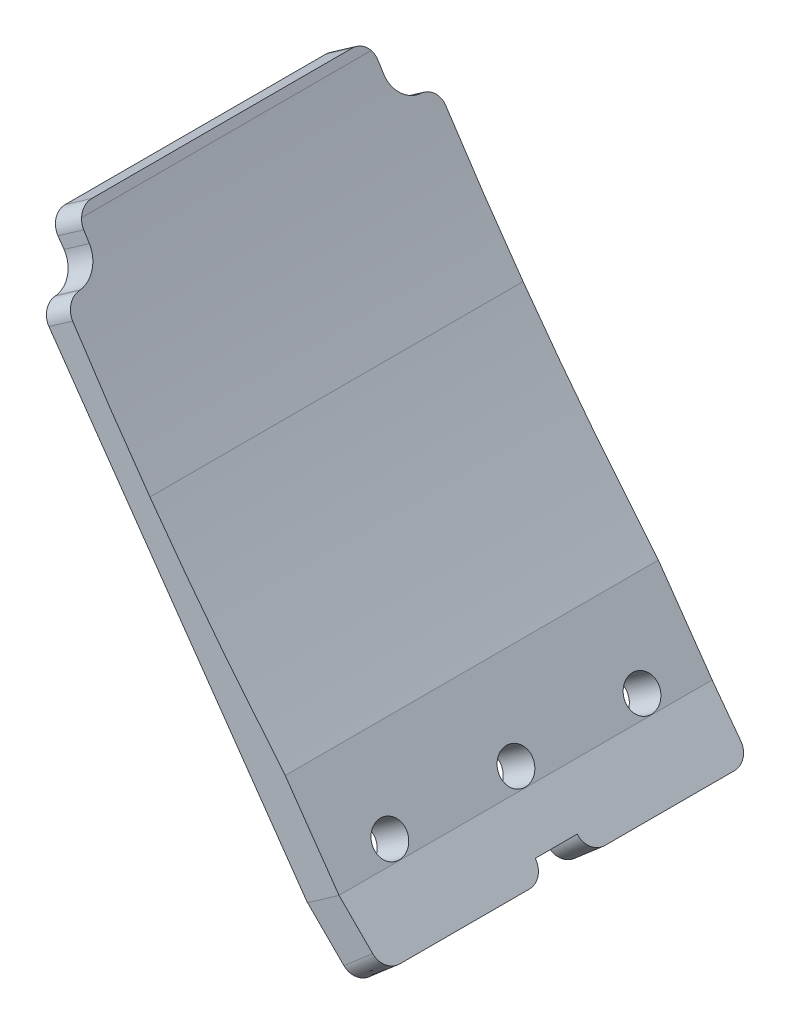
ISO-10303-21;
HEADER;
FILE_DESCRIPTION(('STEP AP214'),'2;1');
FILE_NAME('part.step','',(''),(''),'','','');
FILE_SCHEMA(('AUTOMOTIVE_DESIGN { 1 0 10303 214 1 1 1 1 }'));
ENDSEC;
DATA;
#1=APPLICATION_CONTEXT('core data for automotive mechanical design processes');
#2=APPLICATION_PROTOCOL_DEFINITION('international standard','automotive_design',2000,#1);
#3=PRODUCT_CONTEXT('',#1,'mechanical');
#4=PRODUCT('Part','Part','',(#3));
#5=PRODUCT_RELATED_PRODUCT_CATEGORY('part','',(#4));
#6=PRODUCT_DEFINITION_FORMATION('','',#4);
#7=PRODUCT_DEFINITION_CONTEXT('part definition',#1,'design');
#8=PRODUCT_DEFINITION('design','',#6,#7);
#9=PRODUCT_DEFINITION_SHAPE('','',#8);
#10=(LENGTH_UNIT() NAMED_UNIT(*) SI_UNIT(.MILLI.,.METRE.));
#11=(NAMED_UNIT(*) PLANE_ANGLE_UNIT() SI_UNIT($,.RADIAN.));
#12=(NAMED_UNIT(*) SI_UNIT($,.STERADIAN.) SOLID_ANGLE_UNIT());
#13=UNCERTAINTY_MEASURE_WITH_UNIT(LENGTH_MEASURE(1.E-05),#10,'distance_accuracy_value','');
#14=(GEOMETRIC_REPRESENTATION_CONTEXT(3) GLOBAL_UNCERTAINTY_ASSIGNED_CONTEXT((#13)) GLOBAL_UNIT_ASSIGNED_CONTEXT((#10,
#11,#12)) REPRESENTATION_CONTEXT('',''));
#15=CARTESIAN_POINT('',(0.,0.,0.));
#16=DIRECTION('',(0.,0.,1.));
#17=DIRECTION('',(1.,0.,0.));
#18=AXIS2_PLACEMENT_3D('',#15,#16,#17);
#19=CARTESIAN_POINT('',(42.2592479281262,-266.681028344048,-269.236604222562));
#20=DIRECTION('',(0.653423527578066,-0.756992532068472,0.));
#21=DIRECTION('',(0.756992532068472,0.653423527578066,0.));
#22=AXIS2_PLACEMENT_3D('',#19,#20,#21);
#23=PLANE('',#22);
#24=DIRECTION('',(0.,0.,1.));
#25=VECTOR('',#24,1.);
#26=CARTESIAN_POINT('',(42.2592479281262,-266.681028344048,-269.236604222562));
#27=LINE('',#26,#25);
#28=CARTESIAN_POINT('',(42.2592479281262,-266.681028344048,4.5));
#29=VERTEX_POINT('',#28);
#30=CARTESIAN_POINT('',(42.2592479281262,-266.681028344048,19.88229845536));
#31=VERTEX_POINT('',#30);
#32=EDGE_CURVE('E535',#29,#31,#27,.T.);
#33=ORIENTED_EDGE('',*,*,#32,.F.);
#34=DIRECTION('',(0.756992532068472,0.653423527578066,0.));
#35=VECTOR('',#34,1.);
#36=CARTESIAN_POINT('',(45.7025317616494,-263.708842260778,4.5));
#37=LINE('',#36,#35);
#38=CARTESIAN_POINT('',(45.7025317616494,-263.708842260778,4.5));
#39=VERTEX_POINT('',#38);
#40=EDGE_CURVE('E695',#29,#39,#37,.T.);
#41=ORIENTED_EDGE('',*,*,#40,.T.);
#42=DIRECTION('',(0.,0.,1.));
#43=VECTOR('',#42,1.);
#44=CARTESIAN_POINT('',(45.7025317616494,-263.708842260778,-269.236604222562));
#45=LINE('',#44,#43);
#46=CARTESIAN_POINT('',(45.7025317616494,-263.708842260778,19.9055115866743));
#47=VERTEX_POINT('',#46);
#48=EDGE_CURVE('E526',#39,#47,#45,.T.);
#49=ORIENTED_EDGE('',*,*,#48,.T.);
#50=CARTESIAN_POINT('',(41.3297140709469,-267.48338671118,19.8760526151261));
#51=CARTESIAN_POINT('',(41.3224049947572,-267.489695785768,21.7756351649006));
#52=CARTESIAN_POINT('',(40.0824251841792,-266.053936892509,21.8733774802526));
#53=CARTESIAN_POINT('',(41.7722214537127,-267.101421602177,19.879023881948));
#54=CARTESIAN_POINT('',(41.7649040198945,-267.107737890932,21.7785737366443));
#55=CARTESIAN_POINT('',(40.5249498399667,-265.672002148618,21.8763469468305));
#56=CARTESIAN_POINT('',(42.2147288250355,-266.719456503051,19.8819981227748));
#57=CARTESIAN_POINT('',(42.2074066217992,-266.72577690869,21.7815152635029));
#58=CARTESIAN_POINT('',(40.9674745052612,-265.29006745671,21.8793193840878));
#59=CARTESIAN_POINT('',(43.1008758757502,-265.954548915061,19.8879601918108));
#60=CARTESIAN_POINT('',(43.0935441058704,-265.96087757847,21.7874117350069));
#61=CARTESIAN_POINT('',(41.8536562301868,-264.525220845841,21.8852778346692));
#62=CARTESIAN_POINT('',(43.5445155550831,-265.571606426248,19.8909480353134));
#63=CARTESIAN_POINT('',(43.5371789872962,-265.577939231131,21.7903666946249));
#64=CARTESIAN_POINT('',(42.2973132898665,-264.142308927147,21.8882638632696));
#65=CARTESIAN_POINT('',(44.4295302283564,-264.807676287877,19.8969144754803));
#66=CARTESIAN_POINT('',(44.422184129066,-264.814017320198,21.7962674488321));
#67=CARTESIAN_POINT('',(43.18236267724,-263.378439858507,21.8942266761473));
#68=CARTESIAN_POINT('',(44.8709052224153,-264.426688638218,19.8998930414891));
#69=CARTESIAN_POINT('',(44.8635543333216,-264.433033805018,21.7992132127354));
#70=CARTESIAN_POINT('',(43.6237550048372,-262.997482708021,21.8972034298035));
#71=CARTESIAN_POINT('',(45.7547875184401,-263.6637359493,19.9058638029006));
#72=CARTESIAN_POINT('',(45.747427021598,-263.670089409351,21.8051181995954));
#73=CARTESIAN_POINT('',(44.507672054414,-262.234591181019,21.9031705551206));
#74=CARTESIAN_POINT('',(46.1972948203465,-263.281770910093,19.9088560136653));
#75=CARTESIAN_POINT('',(46.1899295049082,-263.288128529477,21.8080774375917));
#76=CARTESIAN_POINT('',(44.9501967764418,-261.852656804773,21.9061609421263));
#77=CARTESIAN_POINT('',(46.6398021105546,-262.899805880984,19.9118512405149));
#78=CARTESIAN_POINT('',(46.6324356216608,-262.906164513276,21.8110396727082));
#79=CARTESIAN_POINT('',(45.3927215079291,-261.470722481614,21.9091543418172));
#80=(BOUNDED_SURFACE() B_SPLINE_SURFACE(3,2,((#50,#51,#52),(#53,#54,#55),(#56,#57,#58),(#59,#60,
#61),(#62,#63,#64),(#65,#66,#67),(#68,#69,#70),(#71,#72,#73),(#74,#75,#76),(#77,#78,#79)),
.UNSPECIFIED.,.F.,.F.,.F.) B_SPLINE_SURFACE_WITH_KNOTS((4,2,2,2,4),(3,3),(0.,1.75370197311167,
3.51189149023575,5.26110591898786,7.01480789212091),(0.,1.),
.UNSPECIFIED.) GEOMETRIC_REPRESENTATION_ITEM() RATIONAL_B_SPLINE_SURFACE(((1.,0.725070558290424,
1.),(1.,0.725076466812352,1.),(1.,0.7250823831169,1.),(1.,0.725094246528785,1.),(1.,
0.725100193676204,1.),(1.,0.725112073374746,1.),(1.,0.725118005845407,1.),(1.,0.72512990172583,
1.),(1.,0.725135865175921,1.),(1.,0.725141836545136,1.))) REPRESENTATION_ITEM('') SURFACE());
#81=CARTESIAN_POINT('',(46.6398021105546,-262.899805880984,19.9118512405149));
#82=CARTESIAN_POINT('',(46.1972948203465,-263.281770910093,19.9088560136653));
#83=CARTESIAN_POINT('',(45.75478751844,-263.6637359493,19.9058638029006));
#84=CARTESIAN_POINT('',(44.8709052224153,-264.426688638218,19.8998930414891));
#85=CARTESIAN_POINT('',(44.4295302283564,-264.807676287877,19.8969144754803));
#86=CARTESIAN_POINT('',(43.5445155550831,-265.571606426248,19.8909480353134));
#87=CARTESIAN_POINT('',(43.1008758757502,-265.954548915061,19.8879601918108));
#88=CARTESIAN_POINT('',(42.2147288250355,-266.719456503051,19.8819981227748));
#89=CARTESIAN_POINT('',(41.7722214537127,-267.101421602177,19.879023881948));
#90=CARTESIAN_POINT('',(41.3297140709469,-267.48338671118,19.8760526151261));
#91=B_SPLINE_CURVE_WITH_KNOTS('',3,(#81,#82,#83,#84,#85,#86,#87,#88,#89,#90),.UNSPECIFIED.,.F.,
.F.,(4,2,2,2,4),(0.,1.75370197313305,3.50291640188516,5.26110591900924,7.01480789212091),.UNSPECIFIED.);
#92=EDGE_CURVE('E566',#47,#31,#91,.T.);
#93=ORIENTED_EDGE('',*,*,#92,.T.);
#94=EDGE_LOOP('',(#33,#41,#49,#93));
#95=FACE_BOUND('',#94,.T.);
#96=ADVANCED_FACE('F37',(#95),#23,.T.);
#97=CARTESIAN_POINT('',(40.1563758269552,-182.747718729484,22.2));
#98=DIRECTION('',(0.,0.,1.));
#99=DIRECTION('',(-0.819581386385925,-0.572962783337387,0.));
#100=AXIS2_PLACEMENT_3D('',#97,#98,#99);
#101=PLANE('',#100);
#102=CARTESIAN_POINT('',(18.2583800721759,-228.176085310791,22.2));
#103=CARTESIAN_POINT('',(15.9676877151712,-224.983559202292,22.2));
#104=CARTESIAN_POINT('',(11.5282319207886,-218.545253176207,22.2));
#105=CARTESIAN_POINT('',(7.23592251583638,-211.817007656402,22.2));
#106=CARTESIAN_POINT('',(5.15863690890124,-208.434492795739,22.2));
#107=B_SPLINE_CURVE_WITH_KNOTS('',3,(#102,#103,#104,#105,#106),.UNSPECIFIED.,.F.,.F.,(4,1,4),
(0.88872910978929,0.944364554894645,1.),.UNSPECIFIED.);
#108=CARTESIAN_POINT('',(18.2583800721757,-228.176085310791,22.2));
#109=VERTEX_POINT('',#108);
#110=CARTESIAN_POINT('',(9.0689965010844,-214.652788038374,22.2));
#111=VERTEX_POINT('',#110);
#112=EDGE_CURVE('E572',#109,#111,#107,.T.);
#113=ORIENTED_EDGE('',*,*,#112,.T.);
#114=DIRECTION('',(0.819581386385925,0.572962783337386,0.));
#115=VECTOR('',#114,1.);
#116=CARTESIAN_POINT('',(6.24886183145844,-216.624321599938,22.2));
#117=LINE('',#116,#115);
#118=CARTESIAN_POINT('',(6.24886183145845,-216.624321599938,22.2));
#119=VERTEX_POINT('',#118);
#120=EDGE_CURVE('E337',#111,#119,#117,.F.);
#121=ORIENTED_EDGE('',*,*,#120,.T.);
#122=DIRECTION('',(0.572962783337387,-0.819581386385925,0.));
#123=VECTOR('',#122,1.);
#124=CARTESIAN_POINT('',(5.09976593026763,-214.980623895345,22.2));
#125=LINE('',#124,#123);
#126=CARTESIAN_POINT('',(36.9958269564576,-260.605608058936,22.2));
#127=VERTEX_POINT('',#126);
#128=EDGE_CURVE('E570',#119,#127,#125,.T.);
#129=ORIENTED_EDGE('',*,*,#128,.T.);
#130=DIRECTION('',(0.819581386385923,0.57296278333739,0.));
#131=VECTOR('',#130,1.);
#132=CARTESIAN_POINT('',(36.9958269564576,-260.605608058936,22.2));
#133=LINE('',#132,#131);
#134=CARTESIAN_POINT('',(40.7552605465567,-257.977418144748,22.2));
#135=VERTEX_POINT('',#134);
#136=EDGE_CURVE('E567',#127,#135,#133,.T.);
#137=ORIENTED_EDGE('',*,*,#136,.T.);
#138=DIRECTION('',(-0.572962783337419,0.819581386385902,0.));
#139=VECTOR('',#138,1.);
#140=CARTESIAN_POINT('',(34.3556132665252,-248.823190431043,22.2));
#141=LINE('',#140,#139);
#142=CARTESIAN_POINT('',(34.3556132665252,-248.823190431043,22.2));
#143=VERTEX_POINT('',#142);
#144=EDGE_CURVE('E563',#135,#143,#141,.T.);
#145=ORIENTED_EDGE('',*,*,#144,.T.);
#146=CARTESIAN_POINT('',(34.3556132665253,-248.823190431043,22.2));
#147=CARTESIAN_POINT('',(30.7045153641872,-244.496697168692,22.2));
#148=CARTESIAN_POINT('',(25.2572227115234,-237.715035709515,22.2));
#149=CARTESIAN_POINT('',(20.0270286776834,-230.641041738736,22.2));
#150=CARTESIAN_POINT('',(18.2583800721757,-228.176085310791,22.2));
#151=B_SPLINE_CURVE_WITH_KNOTS('',3,(#146,#147,#148,#149,#150),.UNSPECIFIED.,.F.,.F.,(4,1,4),
(0.819228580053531,0.9375,1.),.UNSPECIFIED.);
#152=EDGE_CURVE('E577',#143,#109,#151,.T.);
#153=ORIENTED_EDGE('',*,*,#152,.T.);
#154=EDGE_LOOP('',(#113,#121,#129,#137,#145,#153));
#155=FACE_BOUND('',#154,.T.);
#156=ADVANCED_FACE('F437',(#155),#101,.T.);
#157=CARTESIAN_POINT('',(18.2583800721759,-228.176085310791,88.1908238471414));
#158=CARTESIAN_POINT('',(15.9676877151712,-224.983559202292,88.1908238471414));
#159=CARTESIAN_POINT('',(11.5282319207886,-218.545253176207,88.1908238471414));
#160=CARTESIAN_POINT('',(7.23592251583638,-211.817007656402,88.1908238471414));
#161=CARTESIAN_POINT('',(5.15863690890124,-208.434492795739,88.1908238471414));
#162=B_SPLINE_CURVE_WITH_KNOTS('',3,(#157,#158,#159,#160,#161),.UNSPECIFIED.,.F.,.F.,(4,1,4),
(0.88872910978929,0.944364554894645,1.),.UNSPECIFIED.);
#163=DIRECTION('',(0.,0.,-1.));
#164=VECTOR('',#163,1.);
#165=SURFACE_OF_LINEAR_EXTRUSION('',#162,#164);
#166=DIRECTION('',(0.,0.,-1.));
#167=VECTOR('',#166,1.);
#168=CARTESIAN_POINT('',(5.15863690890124,-208.434492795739,88.1908238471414));
#169=LINE('',#168,#167);
#170=CARTESIAN_POINT('',(5.15863690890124,-208.434492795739,17.2320508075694));
#171=VERTEX_POINT('',#170);
#172=CARTESIAN_POINT('',(5.15863690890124,-208.434492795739,-17.2320508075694));
#173=VERTEX_POINT('',#172);
#174=EDGE_CURVE('E586',#171,#173,#169,.T.);
#175=ORIENTED_EDGE('',*,*,#174,.F.);
#176=CARTESIAN_POINT('',(5.15863690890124,-208.434492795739,17.2320508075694));
#177=CARTESIAN_POINT('',(5.18448052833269,-208.476575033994,17.2605198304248));
#178=CARTESIAN_POINT('',(5.21097158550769,-208.51969093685,17.2868714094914));
#179=CARTESIAN_POINT('',(5.26505895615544,-208.607676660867,17.3351809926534));
#180=CARTESIAN_POINT('',(5.29265557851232,-208.652546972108,17.3571377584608));
#181=CARTESIAN_POINT('',(5.34814715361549,-208.74272487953,17.3960601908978));
#182=CARTESIAN_POINT('',(5.37602296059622,-208.78800237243,17.4131229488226));
#183=CARTESIAN_POINT('',(5.4324325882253,-208.879577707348,17.4427531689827));
#184=CARTESIAN_POINT('',(5.46096613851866,-208.925875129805,17.4553224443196));
#185=CARTESIAN_POINT('',(5.52153227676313,-209.024094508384,17.4769664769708));
#186=CARTESIAN_POINT('',(5.55361745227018,-209.076096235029,17.4855351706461));
#187=CARTESIAN_POINT('',(5.61848431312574,-209.181165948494,17.4970910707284));
#188=CARTESIAN_POINT('',(5.65126972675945,-209.23423921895,17.5000093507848));
#189=CARTESIAN_POINT('',(5.68406918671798,-209.287302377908,17.5));
#190=B_SPLINE_CURVE_WITH_KNOTS('',3,(#176,#177,#178,#179,#180,#181,#182,#183,#184,#185,#186,
#187,#188,#189),.UNSPECIFIED.,.F.,.F.,(4,2,2,2,2,2,4),(0.,0.17095500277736,0.341958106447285,
0.509287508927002,0.676549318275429,0.861388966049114,1.0484695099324),.UNSPECIFIED.);
#191=CARTESIAN_POINT('',(5.68406918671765,-209.287302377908,17.5));
#192=VERTEX_POINT('',#191);
#193=EDGE_CURVE('E442',#171,#192,#190,.T.);
#194=ORIENTED_EDGE('',*,*,#193,.T.);
#195=CARTESIAN_POINT('',(18.2583800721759,-228.176085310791,17.5));
#196=CARTESIAN_POINT('',(15.9676877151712,-224.983559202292,17.5));
#197=CARTESIAN_POINT('',(11.5282319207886,-218.545253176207,17.5));
#198=CARTESIAN_POINT('',(7.23592251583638,-211.817007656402,17.5));
#199=CARTESIAN_POINT('',(5.15863690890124,-208.434492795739,17.5));
#200=B_SPLINE_CURVE_WITH_KNOTS('',3,(#195,#196,#197,#198,#199),.UNSPECIFIED.,.F.,.F.,(4,1,4),
(0.88872910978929,0.944364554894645,1.),.UNSPECIFIED.);
#201=CARTESIAN_POINT('',(6.35367153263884,-210.366170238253,17.5));
#202=VERTEX_POINT('',#201);
#203=EDGE_CURVE('E303',#192,#202,#200,.F.);
#204=ORIENTED_EDGE('',*,*,#203,.T.);
#205=CARTESIAN_POINT('',(6.35367153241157,-210.366170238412,17.5));
#206=CARTESIAN_POINT('',(6.39981860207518,-210.440220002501,17.4999935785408));
#207=CARTESIAN_POINT('',(6.44599260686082,-210.5142494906,17.5036038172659));
#208=CARTESIAN_POINT('',(6.53808155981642,-210.661770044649,17.5180085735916));
#209=CARTESIAN_POINT('',(6.58399650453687,-210.735261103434,17.5288031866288));
#210=CARTESIAN_POINT('',(6.67525510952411,-210.881208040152,17.5575282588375));
#211=CARTESIAN_POINT('',(6.72059874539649,-210.953663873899,17.5754590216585));
#212=CARTESIAN_POINT('',(6.81038085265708,-211.097013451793,17.6183363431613));
#213=CARTESIAN_POINT('',(6.85481934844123,-211.167907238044,17.6432827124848));
#214=CARTESIAN_POINT('',(6.98562110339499,-211.376413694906,17.7280164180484));
#215=CARTESIAN_POINT('',(7.07027533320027,-211.511138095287,17.797953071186));
#216=CARTESIAN_POINT('',(7.2314110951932,-211.767218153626,17.9623445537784));
#217=CARTESIAN_POINT('',(7.30797519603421,-211.888709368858,18.0565091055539));
#218=CARTESIAN_POINT('',(7.4508818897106,-212.115195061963,18.2660824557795));
#219=CARTESIAN_POINT('',(7.5173446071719,-212.220383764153,18.3811986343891));
#220=CARTESIAN_POINT('',(7.63838565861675,-212.411759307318,18.6289210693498));
#221=CARTESIAN_POINT('',(7.69310883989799,-212.498177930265,18.7612773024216));
#222=CARTESIAN_POINT('',(7.78947918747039,-212.650248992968,19.039523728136));
#223=CARTESIAN_POINT('',(7.83127415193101,-212.716136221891,19.1852342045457));
#224=CARTESIAN_POINT('',(7.89768717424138,-212.820778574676,19.4719403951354));
#225=CARTESIAN_POINT('',(7.92363720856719,-212.861639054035,19.6118575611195));
#226=CARTESIAN_POINT('',(7.95412603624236,-212.909633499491,19.8275789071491));
#227=CARTESIAN_POINT('',(7.96293419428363,-212.923496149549,19.9013594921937));
#228=CARTESIAN_POINT('',(7.97746998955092,-212.946370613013,20.0499836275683));
#229=CARTESIAN_POINT('',(7.98319701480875,-212.955381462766,20.1248273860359));
#230=CARTESIAN_POINT('',(7.98735933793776,-212.961930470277,20.2));
#231=B_SPLINE_CURVE_WITH_KNOTS('',3,(#205,#206,#207,#208,#209,#210,#211,#212,#213,#214,#215,
#216,#217,#218,#219,#220,#221,#222,#223,#224,#225,#226,#227,#228,#229,#230),.UNSPECIFIED.,.F.,
.F.,(4,2,2,2,2,2,2,2,2,2,2,2,4),(0.,0.261675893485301,0.523355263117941,0.785045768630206,
1.04672921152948,1.56553595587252,2.07839490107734,2.58457519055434,3.08409618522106,
3.57767530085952,4.02005974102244,4.24661983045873,4.47322490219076),.UNSPECIFIED.);
#232=CARTESIAN_POINT('',(7.98735933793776,-212.961930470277,20.2));
#233=VERTEX_POINT('',#232);
#234=EDGE_CURVE('E307',#202,#233,#231,.T.);
#235=ORIENTED_EDGE('',*,*,#234,.T.);
#236=CARTESIAN_POINT('',(7.98735933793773,-212.961930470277,20.2));
#237=CARTESIAN_POINT('',(7.98874949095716,-212.964117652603,20.2250882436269));
#238=CARTESIAN_POINT('',(7.98990708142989,-212.965938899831,20.2502205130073));
#239=CARTESIAN_POINT('',(7.99175462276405,-212.968845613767,20.3005447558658));
#240=CARTESIAN_POINT('',(7.99244457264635,-212.969931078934,20.3257367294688));
#241=CARTESIAN_POINT('',(7.99379556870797,-212.972056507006,20.4006050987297));
#242=CARTESIAN_POINT('',(7.99377930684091,-212.972030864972,20.4503265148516));
#243=CARTESIAN_POINT('',(7.99284103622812,-212.97055480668,20.5));
#244=B_SPLINE_CURVE_WITH_KNOTS('',3,(#236,#237,#238,#239,#240,#241,#242,#243),.UNSPECIFIED.,.F.,
.F.,(4,2,2,4),(0.,0.0756598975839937,0.15131995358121,0.300375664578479),.UNSPECIFIED.);
#245=CARTESIAN_POINT('',(7.99187566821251,-212.969036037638,20.3072563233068));
#246=VERTEX_POINT('',#245);
#247=EDGE_CURVE('E277',#233,#246,#244,.T.);
#248=ORIENTED_EDGE('',*,*,#247,.T.);
#249=CARTESIAN_POINT('',(7.99187566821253,-212.969036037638,20.3072563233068));
#250=CARTESIAN_POINT('',(7.99349525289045,-212.971583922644,20.3634110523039));
#251=CARTESIAN_POINT('',(7.99638609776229,-212.976132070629,20.4194113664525));
#252=CARTESIAN_POINT('',(8.00468784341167,-212.989191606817,20.5307563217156));
#253=CARTESIAN_POINT('',(8.01009861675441,-212.997702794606,20.5861009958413));
#254=CARTESIAN_POINT('',(8.0300555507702,-213.029091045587,20.7504584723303));
#255=CARTESIAN_POINT('',(8.04833184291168,-213.057831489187,20.8579827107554));
#256=CARTESIAN_POINT('',(8.09432621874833,-213.130123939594,21.0657834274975));
#257=CARTESIAN_POINT('',(8.12204874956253,-213.173682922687,21.166056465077));
#258=CARTESIAN_POINT('',(8.18616114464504,-213.274353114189,21.356511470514));
#259=CARTESIAN_POINT('',(8.22254926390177,-213.331461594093,21.4466954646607));
#260=CARTESIAN_POINT('',(8.30299998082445,-213.457622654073,21.6144645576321));
#261=CARTESIAN_POINT('',(8.34706610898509,-213.5266807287,21.6920438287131));
#262=CARTESIAN_POINT('',(8.44165104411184,-213.674774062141,21.8323883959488));
#263=CARTESIAN_POINT('',(8.49217187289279,-213.75381244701,21.8951490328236));
#264=CARTESIAN_POINT('',(8.5982984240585,-213.919678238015,22.004116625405));
#265=CARTESIAN_POINT('',(8.65391030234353,-214.006515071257,22.0503031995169));
#266=CARTESIAN_POINT('',(8.76858691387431,-214.185389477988,22.1246766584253));
#267=CARTESIAN_POINT('',(8.82764815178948,-214.277421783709,22.1528814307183));
#268=CARTESIAN_POINT('',(8.91752294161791,-214.417316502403,22.1811346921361));
#269=CARTESIAN_POINT('',(8.94770193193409,-214.464266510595,22.1882101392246));
#270=CARTESIAN_POINT('',(9.00824431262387,-214.558402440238,22.1976384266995));
#271=CARTESIAN_POINT('',(9.03860728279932,-214.605587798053,22.1999995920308));
#272=CARTESIAN_POINT('',(9.06899650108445,-214.652788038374,22.1999999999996));
#273=B_SPLINE_CURVE_WITH_KNOTS('',3,(#249,#250,#251,#252,#253,#254,#255,#256,#257,#258,#259,
#260,#261,#262,#263,#264,#265,#266,#267,#268,#269,#270,#271,#272),.UNSPECIFIED.,.F.,.F.,(4,2,2,
2,2,2,2,2,2,2,2,4),(0.,0.168603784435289,0.337199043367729,0.673831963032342,1.01062358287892,
1.34734743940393,1.68422653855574,2.02121141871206,2.35860928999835,2.69567100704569,
2.86427742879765,3.03258584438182),.UNSPECIFIED.);
#274=EDGE_CURVE('E336',#246,#111,#273,.T.);
#275=ORIENTED_EDGE('',*,*,#274,.T.);
#276=ORIENTED_EDGE('',*,*,#112,.F.);
#277=DIRECTION('',(0.,0.,-1.));
#278=VECTOR('',#277,1.);
#279=CARTESIAN_POINT('',(18.2583800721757,-228.176085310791,88.1908238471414));
#280=LINE('',#279,#278);
#281=CARTESIAN_POINT('',(18.2583800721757,-228.176085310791,-22.2000000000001));
#282=VERTEX_POINT('',#281);
#283=EDGE_CURVE('E417',#109,#282,#280,.T.);
#284=ORIENTED_EDGE('',*,*,#283,.T.);
#285=CARTESIAN_POINT('',(18.2583800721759,-228.176085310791,-22.2000000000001));
#286=CARTESIAN_POINT('',(15.9676877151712,-224.983559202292,-22.2000000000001));
#287=CARTESIAN_POINT('',(11.5282319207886,-218.545253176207,-22.2000000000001));
#288=CARTESIAN_POINT('',(7.23592251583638,-211.817007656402,-22.2000000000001));
#289=CARTESIAN_POINT('',(5.15863690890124,-208.434492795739,-22.2000000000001));
#290=B_SPLINE_CURVE_WITH_KNOTS('',3,(#285,#286,#287,#288,#289),.UNSPECIFIED.,.F.,.F.,(4,1,4),
(0.88872910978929,0.944364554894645,1.),.UNSPECIFIED.);
#291=CARTESIAN_POINT('',(9.06899650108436,-214.652788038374,-22.2000000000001));
#292=VERTEX_POINT('',#291);
#293=EDGE_CURVE('E541',#282,#292,#290,.T.);
#294=ORIENTED_EDGE('',*,*,#293,.T.);
#295=CARTESIAN_POINT('',(9.06899650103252,-214.652788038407,-22.2000000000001));
#296=CARTESIAN_POINT('',(9.03849367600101,-214.605411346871,-22.1999996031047));
#297=CARTESIAN_POINT('',(9.00801734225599,-214.558049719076,-22.1976207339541));
#298=CARTESIAN_POINT('',(8.94730581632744,-214.463650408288,-22.1881305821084));
#299=CARTESIAN_POINT('',(8.91707061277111,-214.416612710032,-22.1810195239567));
#300=CARTESIAN_POINT('',(8.82710092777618,-214.276569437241,-22.1526549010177));
#301=CARTESIAN_POINT('',(8.76800326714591,-214.184479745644,-22.1243697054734));
#302=CARTESIAN_POINT('',(8.65329430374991,-214.00555356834,-22.0498312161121));
#303=CARTESIAN_POINT('',(8.59768471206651,-213.918719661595,-22.0035691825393));
#304=CARTESIAN_POINT('',(8.49151708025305,-213.752788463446,-21.8943931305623));
#305=CARTESIAN_POINT('',(8.44095795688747,-213.673689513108,-21.8314826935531));
#306=CARTESIAN_POINT('',(8.34631809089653,-213.525508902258,-21.6908093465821));
#307=CARTESIAN_POINT('',(8.30223551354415,-213.456424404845,-21.6130506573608));
#308=CARTESIAN_POINT('',(8.22174768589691,-213.330203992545,-21.4448401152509));
#309=CARTESIAN_POINT('',(8.18534482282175,-213.273071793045,-21.354384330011));
#310=CARTESIAN_POINT('',(8.12126618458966,-213.172453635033,-21.1634262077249));
#311=CARTESIAN_POINT('',(8.09358679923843,-213.128962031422,-21.0629280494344));
#312=CARTESIAN_POINT('',(8.04772492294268,-213.056877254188,-20.8547420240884));
#313=CARTESIAN_POINT('',(8.0295327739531,-213.028268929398,-20.7470615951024));
#314=CARTESIAN_POINT('',(8.00978940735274,-212.997216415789,-20.5830807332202));
#315=CARTESIAN_POINT('',(8.00447318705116,-212.988853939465,-20.5282685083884));
#316=CARTESIAN_POINT('',(7.99631889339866,-212.976026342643,-20.4181058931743));
#317=CARTESIAN_POINT('',(7.99347646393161,-212.971554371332,-20.3627566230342));
#318=CARTESIAN_POINT('',(7.99187566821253,-212.969036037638,-20.3072563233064));
#319=B_SPLINE_CURVE_WITH_KNOTS('',3,(#295,#296,#297,#298,#299,#300,#301,#302,#303,#304,#305,
#306,#307,#308,#309,#310,#311,#312,#313,#314,#315,#316,#317,#318),.UNSPECIFIED.,.F.,.F.,(4,2,2,
2,2,2,2,2,2,2,2,4),(0.,0.168936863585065,0.337865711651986,0.675181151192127,1.01266078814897,
1.35006788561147,1.68737921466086,2.02479524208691,2.36207144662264,2.69900362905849,
2.86593842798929,3.03257867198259),.UNSPECIFIED.);
#320=CARTESIAN_POINT('',(7.99187566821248,-212.969036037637,-20.3072563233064));
#321=VERTEX_POINT('',#320);
#322=EDGE_CURVE('E65',#292,#321,#319,.T.);
#323=ORIENTED_EDGE('',*,*,#322,.T.);
#324=CARTESIAN_POINT('',(7.99284103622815,-212.97055480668,-20.5));
#325=CARTESIAN_POINT('',(7.99331581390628,-212.971301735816,-20.4747935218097));
#326=CARTESIAN_POINT('',(7.9935542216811,-212.971676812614,-20.4495726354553));
#327=CARTESIAN_POINT('',(7.9935595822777,-212.971685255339,-20.3991306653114));
#328=CARTESIAN_POINT('',(7.99332653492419,-212.97131862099,-20.3739095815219));
#329=CARTESIAN_POINT('',(7.99193614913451,-212.969131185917,-20.2990434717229));
#330=CARTESIAN_POINT('',(7.9901014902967,-212.966244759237,-20.2494394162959));
#331=CARTESIAN_POINT('',(7.98735933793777,-212.961930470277,-20.2000000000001));
#332=B_SPLINE_CURVE_WITH_KNOTS('',3,(#324,#325,#326,#327,#328,#329,#330,#331),.UNSPECIFIED.,.F.,
.F.,(4,2,2,4),(0.,0.0756601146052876,0.151320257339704,0.300375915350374),.UNSPECIFIED.);
#333=CARTESIAN_POINT('',(7.98735933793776,-212.961930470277,-20.2000000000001));
#334=VERTEX_POINT('',#333);
#335=EDGE_CURVE('E452',#321,#334,#332,.T.);
#336=ORIENTED_EDGE('',*,*,#335,.T.);
#337=CARTESIAN_POINT('',(7.98735933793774,-212.961930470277,-20.2000000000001));
#338=CARTESIAN_POINT('',(7.98278188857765,-212.954728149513,-20.1172437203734));
#339=CARTESIAN_POINT('',(7.97629822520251,-212.944526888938,-20.034857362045));
#340=CARTESIAN_POINT('',(7.95959722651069,-212.918244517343,-19.8713865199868));
#341=CARTESIAN_POINT('',(7.94937881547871,-212.902161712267,-19.790302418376));
#342=CARTESIAN_POINT('',(7.92534260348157,-212.864321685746,-19.630397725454));
#343=CARTESIAN_POINT('',(7.91154077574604,-212.842589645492,-19.5515687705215));
#344=CARTESIAN_POINT('',(7.8804422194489,-212.793607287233,-19.3963932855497));
#345=CARTESIAN_POINT('',(7.86314699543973,-212.766359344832,-19.3200457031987));
#346=CARTESIAN_POINT('',(7.82542751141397,-212.706911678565,-19.1712249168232));
#347=CARTESIAN_POINT('',(7.80504358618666,-212.674775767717,-19.098716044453));
#348=CARTESIAN_POINT('',(7.76117541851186,-212.60558692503,-18.9571102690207));
#349=CARTESIAN_POINT('',(7.73769198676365,-212.568535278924,-18.8880124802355));
#350=CARTESIAN_POINT('',(7.66284070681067,-212.450380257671,-18.686478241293));
#351=CARTESIAN_POINT('',(7.60704144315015,-212.362228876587,-18.5596814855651));
#352=CARTESIAN_POINT('',(7.48539700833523,-212.169825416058,-18.3246315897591));
#353=CARTESIAN_POINT('',(7.41955270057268,-212.065574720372,-18.2163768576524));
#354=CARTESIAN_POINT('',(7.27965188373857,-211.843771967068,-18.0208371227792));
#355=CARTESIAN_POINT('',(7.20559604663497,-211.726220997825,-17.9335504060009));
#356=CARTESIAN_POINT('',(7.05128631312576,-211.480921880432,-17.7818964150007));
#357=CARTESIAN_POINT('',(6.9710328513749,-211.353174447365,-17.7175275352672));
#358=CARTESIAN_POINT('',(6.80361367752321,-211.086264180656,-17.6113211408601));
#359=CARTESIAN_POINT('',(6.71630757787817,-210.946864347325,-17.570291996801));
#360=CARTESIAN_POINT('',(6.5826298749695,-210.733074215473,-17.5284566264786));
#361=CARTESIAN_POINT('',(6.53698987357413,-210.660022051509,-17.5177929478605));
#362=CARTESIAN_POINT('',(6.44545450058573,-210.513386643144,-17.5035653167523));
#363=CARTESIAN_POINT('',(6.39955912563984,-210.439803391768,-17.5000014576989));
#364=CARTESIAN_POINT('',(6.35367153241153,-210.366170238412,-17.5));
#365=B_SPLINE_CURVE_WITH_KNOTS('',3,(#337,#338,#339,#340,#341,#342,#343,#344,#345,#346,#347,
#348,#349,#350,#351,#352,#353,#354,#355,#356,#357,#358,#359,#360,#361,#362,#363,#364),
.UNSPECIFIED.,.F.,.F.,(4,2,2,2,2,2,2,2,2,2,2,2,2,4),(0.,0.249504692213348,0.499081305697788,
0.747563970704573,0.995939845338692,1.2413144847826,1.48662507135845,1.97685427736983,
2.46704137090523,2.95718838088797,3.44730104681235,3.95349107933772,4.21362188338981,
4.4737561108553),.UNSPECIFIED.);
#366=CARTESIAN_POINT('',(6.35367153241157,-210.366170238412,-17.5));
#367=VERTEX_POINT('',#366);
#368=EDGE_CURVE('E460',#334,#367,#365,.T.);
#369=ORIENTED_EDGE('',*,*,#368,.T.);
#370=CARTESIAN_POINT('',(18.2583800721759,-228.176085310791,-17.5));
#371=CARTESIAN_POINT('',(15.9676877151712,-224.983559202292,-17.5));
#372=CARTESIAN_POINT('',(11.5282319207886,-218.545253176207,-17.5));
#373=CARTESIAN_POINT('',(7.23592251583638,-211.817007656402,-17.5));
#374=CARTESIAN_POINT('',(5.15863690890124,-208.434492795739,-17.5));
#375=B_SPLINE_CURVE_WITH_KNOTS('',3,(#370,#371,#372,#373,#374),.UNSPECIFIED.,.F.,.F.,(4,1,4),
(0.88872910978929,0.944364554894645,1.),.UNSPECIFIED.);
#376=CARTESIAN_POINT('',(5.68406918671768,-209.287302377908,-17.5));
#377=VERTEX_POINT('',#376);
#378=EDGE_CURVE('E633',#367,#377,#375,.T.);
#379=ORIENTED_EDGE('',*,*,#378,.T.);
#380=CARTESIAN_POINT('',(5.68406918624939,-209.287302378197,-17.5));
#381=CARTESIAN_POINT('',(5.65409813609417,-209.238814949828,-17.5000062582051));
#382=CARTESIAN_POINT('',(5.62413955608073,-209.190320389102,-17.4975710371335));
#383=CARTESIAN_POINT('',(5.56445467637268,-209.09365440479,-17.4878615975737));
#384=CARTESIAN_POINT('',(5.53472844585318,-209.045483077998,-17.48058598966));
#385=CARTESIAN_POINT('',(5.47636691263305,-208.950856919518,-17.4614476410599));
#386=CARTESIAN_POINT('',(5.44772189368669,-208.90438744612,-17.4496868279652));
#387=CARTESIAN_POINT('',(5.39107893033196,-208.812450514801,-17.4216642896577));
#388=CARTESIAN_POINT('',(5.3630807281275,-208.766982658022,-17.4054043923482));
#389=CARTESIAN_POINT('',(5.30501139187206,-208.672632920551,-17.3665487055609));
#390=CARTESIAN_POINT('',(5.27503159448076,-208.623894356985,-17.3434666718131));
#391=CARTESIAN_POINT('',(5.21597751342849,-208.527838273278,-17.2918280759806));
#392=CARTESIAN_POINT('',(5.18691861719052,-208.480545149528,-17.2632085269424));
#393=CARTESIAN_POINT('',(5.15863690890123,-208.434492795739,-17.2320508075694));
#394=B_SPLINE_CURVE_WITH_KNOTS('',3,(#380,#381,#382,#383,#384,#385,#386,#387,#388,#389,#390,
#391,#392,#393),.UNSPECIFIED.,.F.,.F.,(4,2,2,2,2,2,4),(0.,0.170955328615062,0.341959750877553,
0.509289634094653,0.676551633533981,0.861389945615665,1.04846948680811),.UNSPECIFIED.);
#395=EDGE_CURVE('E476',#377,#173,#394,.T.);
#396=ORIENTED_EDGE('',*,*,#395,.T.);
#397=EDGE_LOOP('',(#175,#194,#204,#235,#248,#275,#276,#284,#294,#323,#336,#369,#379,#396));
#398=FACE_BOUND('',#397,.T.);
#399=ADVANCED_FACE('F431',(#398),#165,.F.);
#400=CARTESIAN_POINT('',(5.15863690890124,-208.434492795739,88.1908238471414));
#401=DIRECTION('',(-0.852137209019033,-0.523318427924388,0.));
#402=DIRECTION('',(0.523318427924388,-0.852137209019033,0.));
#403=AXIS2_PLACEMENT_3D('',#400,#401,#402);
#404=PLANE('',#403);
#405=DIRECTION('',(0.,0.,-1.));
#406=VECTOR('',#405,1.);
#407=CARTESIAN_POINT('',(4.63439464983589,-207.580851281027,88.1908238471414));
#408=LINE('',#407,#406);
#409=CARTESIAN_POINT('',(4.63439464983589,-207.580851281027,15.5));
#410=VERTEX_POINT('',#409);
#411=CARTESIAN_POINT('',(4.63439464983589,-207.580851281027,-15.5));
#412=VERTEX_POINT('',#411);
#413=EDGE_CURVE('E592',#410,#412,#408,.T.);
#414=ORIENTED_EDGE('',*,*,#413,.F.);
#415=CARTESIAN_POINT('',(5.68287916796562,-209.288134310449,15.5));
#416=DIRECTION('',(-0.852137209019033,-0.523318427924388,0.));
#417=DIRECTION('',(0.523318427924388,-0.852137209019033,0.));
#418=AXIS2_PLACEMENT_3D('',#415,#416,#417);
#419=ELLIPSE('',#418,2.00353066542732,2.);
#420=EDGE_CURVE('E639',#410,#171,#419,.F.);
#421=ORIENTED_EDGE('',*,*,#420,.T.);
#422=ORIENTED_EDGE('',*,*,#174,.T.);
#423=CARTESIAN_POINT('',(5.68287916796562,-209.288134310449,-15.5));
#424=DIRECTION('',(-0.852137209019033,-0.523318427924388,0.));
#425=DIRECTION('',(0.523318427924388,-0.852137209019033,0.));
#426=AXIS2_PLACEMENT_3D('',#423,#424,#425);
#427=ELLIPSE('',#426,2.00353066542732,2.);
#428=EDGE_CURVE('E637',#173,#412,#427,.F.);
#429=ORIENTED_EDGE('',*,*,#428,.T.);
#430=EDGE_LOOP('',(#414,#421,#422,#429));
#431=FACE_BOUND('',#430,.T.);
#432=ADVANCED_FACE('F436',(#431),#404,.F.);
#433=CARTESIAN_POINT('',(1.47213438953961,-209.791562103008,88.1908238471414));
#434=DIRECTION('',(0.57296278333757,-0.819581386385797,0.));
#435=DIRECTION('',(0.819581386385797,0.57296278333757,0.));
#436=AXIS2_PLACEMENT_3D('',#433,#434,#435);
#437=PLANE('',#436);
#438=DIRECTION('',(0.,0.,-1.));
#439=VECTOR('',#438,1.);
#440=CARTESIAN_POINT('',(1.47213438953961,-209.791562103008,88.1908238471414));
#441=LINE('',#440,#439);
#442=CARTESIAN_POINT('',(1.47213438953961,-209.791562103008,15.5));
#443=VERTEX_POINT('',#442);
#444=CARTESIAN_POINT('',(1.47213438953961,-209.791562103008,-15.5));
#445=VERTEX_POINT('',#444);
#446=EDGE_CURVE('E595',#443,#445,#441,.T.);
#447=ORIENTED_EDGE('',*,*,#446,.F.);
#448=DIRECTION('',(-0.819581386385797,-0.57296278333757,0.));
#449=VECTOR('',#448,1.);
#450=CARTESIAN_POINT('',(1.47213438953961,-209.791562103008,15.5));
#451=LINE('',#450,#449);
#452=EDGE_CURVE('E643',#443,#410,#451,.F.);
#453=ORIENTED_EDGE('',*,*,#452,.T.);
#454=ORIENTED_EDGE('',*,*,#413,.T.);
#455=DIRECTION('',(-0.819581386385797,-0.57296278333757,0.));
#456=VECTOR('',#455,1.);
#457=CARTESIAN_POINT('',(1.47213438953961,-209.791562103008,-15.5));
#458=LINE('',#457,#456);
#459=EDGE_CURVE('E642',#412,#445,#458,.T.);
#460=ORIENTED_EDGE('',*,*,#459,.T.);
#461=EDGE_LOOP('',(#447,#453,#454,#460));
#462=FACE_BOUND('',#461,.T.);
#463=ADVANCED_FACE('F680',(#462),#437,.F.);
#464=CARTESIAN_POINT('',(5.09976593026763,-214.980623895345,88.1908238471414));
#465=DIRECTION('',(0.819581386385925,0.572962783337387,0.));
#466=DIRECTION('',(-0.572962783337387,0.819581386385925,0.));
#467=AXIS2_PLACEMENT_3D('',#464,#465,#466);
#468=PLANE('',#467);
#469=CARTESIAN_POINT('',(35.8499013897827,-258.966445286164,15.));
#470=DIRECTION('',(-0.819581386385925,-0.572962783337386,0.));
#471=DIRECTION('',(0.572962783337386,-0.819581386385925,0.));
#472=AXIS2_PLACEMENT_3D('',#469,#470,#471);
#473=CIRCLE('',#472,1.95);
#474=CARTESIAN_POINT('',(36.9671788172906,-260.564628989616,15.));
#475=VERTEX_POINT('',#474);
#476=EDGE_CURVE('E870',#475,#475,#473,.T.);
#477=ORIENTED_EDGE('',*,*,#476,.F.);
#478=EDGE_LOOP('',(#477));
#479=FACE_BOUND('',#478,.T.);
#480=CARTESIAN_POINT('',(35.8499013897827,-258.966445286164,0.));
#481=DIRECTION('',(-0.819581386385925,-0.572962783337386,0.));
#482=DIRECTION('',(0.572962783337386,-0.819581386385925,0.));
#483=AXIS2_PLACEMENT_3D('',#480,#481,#482);
#484=CIRCLE('',#483,1.95);
#485=CARTESIAN_POINT('',(36.9671788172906,-260.564628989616,0.));
#486=VERTEX_POINT('',#485);
#487=EDGE_CURVE('E864',#486,#486,#484,.T.);
#488=ORIENTED_EDGE('',*,*,#487,.F.);
#489=EDGE_LOOP('',(#488));
#490=FACE_BOUND('',#489,.T.);
#491=CARTESIAN_POINT('',(35.8499013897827,-258.966445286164,-15.));
#492=DIRECTION('',(-0.819581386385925,-0.572962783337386,0.));
#493=DIRECTION('',(0.572962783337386,-0.819581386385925,0.));
#494=AXIS2_PLACEMENT_3D('',#491,#492,#493);
#495=CIRCLE('',#494,1.95);
#496=CARTESIAN_POINT('',(36.9671788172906,-260.564628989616,-15.));
#497=VERTEX_POINT('',#496);
#498=EDGE_CURVE('E816',#497,#497,#495,.T.);
#499=ORIENTED_EDGE('',*,*,#498,.F.);
#500=EDGE_LOOP('',(#499));
#501=FACE_BOUND('',#500,.T.);
#502=DIRECTION('',(0.572962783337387,-0.819581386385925,0.));
#503=VECTOR('',#502,1.);
#504=CARTESIAN_POINT('',(3.34450642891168,-212.469853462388,17.5));
#505=LINE('',#504,#503);
#506=CARTESIAN_POINT('',(2.61805995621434,-211.43072487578,17.5));
#507=VERTEX_POINT('',#506);
#508=CARTESIAN_POINT('',(3.34450642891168,-212.469853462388,17.5));
#509=VERTEX_POINT('',#508);
#510=EDGE_CURVE('E300',#507,#509,#505,.T.);
#511=ORIENTED_EDGE('',*,*,#510,.F.);
#512=CARTESIAN_POINT('',(2.61805995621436,-211.43072487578,15.5));
#513=DIRECTION('',(0.819581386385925,0.572962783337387,0.));
#514=DIRECTION('',(-0.572962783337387,0.819581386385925,0.));
#515=AXIS2_PLACEMENT_3D('',#512,#513,#514);
#516=CIRCLE('',#515,2.);
#517=EDGE_CURVE('E648',#507,#443,#516,.F.);
#518=ORIENTED_EDGE('',*,*,#517,.T.);
#519=ORIENTED_EDGE('',*,*,#446,.T.);
#520=CARTESIAN_POINT('',(2.61805995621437,-211.43072487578,-15.5));
#521=DIRECTION('',(0.819581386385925,0.572962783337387,0.));
#522=DIRECTION('',(-0.572962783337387,0.819581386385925,0.));
#523=AXIS2_PLACEMENT_3D('',#520,#521,#522);
#524=CIRCLE('',#523,2.);
#525=CARTESIAN_POINT('',(2.61805995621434,-211.43072487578,-17.5));
#526=VERTEX_POINT('',#525);
#527=EDGE_CURVE('E650',#445,#526,#524,.F.);
#528=ORIENTED_EDGE('',*,*,#527,.T.);
#529=DIRECTION('',(-0.572962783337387,0.819581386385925,0.));
#530=VECTOR('',#529,1.);
#531=CARTESIAN_POINT('',(3.34450642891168,-212.469853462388,-17.5));
#532=LINE('',#531,#530);
#533=CARTESIAN_POINT('',(3.34450642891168,-212.469853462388,-17.5));
#534=VERTEX_POINT('',#533);
#535=EDGE_CURVE('E766',#534,#526,#532,.T.);
#536=ORIENTED_EDGE('',*,*,#535,.F.);
#537=CARTESIAN_POINT('',(3.34450642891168,-212.469853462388,-20.5));
#538=DIRECTION('',(-0.819581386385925,-0.572962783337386,0.));
#539=DIRECTION('',(0.572962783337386,-0.819581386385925,0.));
#540=AXIS2_PLACEMENT_3D('',#537,#538,#539);
#541=ELLIPSE('',#540,3.07891232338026,3.);
#542=CARTESIAN_POINT('',(5.09976593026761,-214.980623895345,-20.2000000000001));
#543=VERTEX_POINT('',#542);
#544=EDGE_CURVE('E761',#543,#534,#541,.T.);
#545=ORIENTED_EDGE('',*,*,#544,.F.);
#546=CARTESIAN_POINT('',(5.10458528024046,-214.987517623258,-20.3072563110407));
#547=CARTESIAN_POINT('',(5.10348644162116,-214.985945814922,-20.2715463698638));
#548=CARTESIAN_POINT('',(5.10188134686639,-214.983649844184,-20.2357940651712));
#549=CARTESIAN_POINT('',(5.0997659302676,-214.980623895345,-20.2000000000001));
#550=B_SPLINE_CURVE_WITH_KNOTS('',3,(#546,#547,#548,#549),.UNSPECIFIED.,.F.,.F.,(4,4),
(0.643245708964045,1.),.UNSPECIFIED.);
#551=CARTESIAN_POINT('',(5.10456977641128,-214.987495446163,-20.3072577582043));
#552=VERTEX_POINT('',#551);
#553=EDGE_CURVE('E663',#552,#543,#550,.T.);
#554=ORIENTED_EDGE('',*,*,#553,.F.);
#555=CARTESIAN_POINT('',(6.24886183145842,-216.624321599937,-20.1999999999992));
#556=DIRECTION('',(0.819581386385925,0.572962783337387,0.));
#557=DIRECTION('',(-0.572962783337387,0.819581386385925,0.));
#558=AXIS2_PLACEMENT_3D('',#555,#556,#557);
#559=CIRCLE('',#558,2.);
#560=CARTESIAN_POINT('',(6.24886183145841,-216.624321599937,-22.2000000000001));
#561=VERTEX_POINT('',#560);
#562=EDGE_CURVE('E622',#552,#561,#559,.F.);
#563=ORIENTED_EDGE('',*,*,#562,.T.);
#564=DIRECTION('',(0.572962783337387,-0.819581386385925,0.));
#565=VECTOR('',#564,1.);
#566=CARTESIAN_POINT('',(5.09976593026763,-214.980623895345,-22.2000000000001));
#567=LINE('',#566,#565);
#568=CARTESIAN_POINT('',(36.9958269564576,-260.605608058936,-22.2000000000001));
#569=VERTEX_POINT('',#568);
#570=EDGE_CURVE('E539',#561,#569,#567,.T.);
#571=ORIENTED_EDGE('',*,*,#570,.T.);
#572=DIRECTION('',(0.,0.,-1.));
#573=VECTOR('',#572,1.);
#574=CARTESIAN_POINT('',(36.9958269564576,-260.605608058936,88.1908238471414));
#575=LINE('',#574,#573);
#576=EDGE_CURVE('E598',#127,#569,#575,.T.);
#577=ORIENTED_EDGE('',*,*,#576,.F.);
#578=ORIENTED_EDGE('',*,*,#128,.F.);
#579=CARTESIAN_POINT('',(6.24886183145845,-216.624321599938,20.1999999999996));
#580=DIRECTION('',(0.819581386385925,0.572962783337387,0.));
#581=DIRECTION('',(-0.572962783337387,0.819581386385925,0.));
#582=AXIS2_PLACEMENT_3D('',#579,#580,#581);
#583=CIRCLE('',#582,2.);
#584=CARTESIAN_POINT('',(5.10456977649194,-214.987495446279,20.3072577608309));
#585=VERTEX_POINT('',#584);
#586=EDGE_CURVE('E334',#119,#585,#583,.F.);
#587=ORIENTED_EDGE('',*,*,#586,.T.);
#588=CARTESIAN_POINT('',(5.0997659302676,-214.980623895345,20.2));
#589=CARTESIAN_POINT('',(5.10188134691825,-214.983649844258,20.2357940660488));
#590=CARTESIAN_POINT('',(5.10348644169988,-214.985945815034,20.2715463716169));
#591=CARTESIAN_POINT('',(5.1045852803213,-214.987517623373,20.3072563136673));
#592=B_SPLINE_CURVE_WITH_KNOTS('',3,(#588,#589,#590,#591),.UNSPECIFIED.,.F.,.F.,(4,4),(0.,
0.356754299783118),.UNSPECIFIED.);
#593=CARTESIAN_POINT('',(5.0997659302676,-214.980623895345,20.2));
#594=VERTEX_POINT('',#593);
#595=EDGE_CURVE('E252',#594,#585,#592,.T.);
#596=ORIENTED_EDGE('',*,*,#595,.F.);
#597=CARTESIAN_POINT('',(3.34450642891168,-212.469853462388,20.5));
#598=DIRECTION('',(-0.819581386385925,-0.572962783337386,0.));
#599=DIRECTION('',(-0.572962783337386,0.819581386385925,0.));
#600=AXIS2_PLACEMENT_3D('',#597,#598,#599);
#601=ELLIPSE('',#600,3.07891232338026,3.);
#602=EDGE_CURVE('E291',#509,#594,#601,.T.);
#603=ORIENTED_EDGE('',*,*,#602,.F.);
#604=EDGE_LOOP('',(#511,#518,#519,#528,#536,#545,#554,#563,#571,#577,#578,#587,#596,#603));
#605=FACE_BOUND('',#604,.T.);
#606=ADVANCED_FACE('F672',(#479,#490,#501,#605),#468,.F.);
#607=CARTESIAN_POINT('',(36.9958269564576,-260.605608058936,88.1908238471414));
#608=DIRECTION('',(-0.57296278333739,0.819581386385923,0.));
#609=DIRECTION('',(-0.819581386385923,-0.57296278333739,0.));
#610=AXIS2_PLACEMENT_3D('',#607,#608,#609);
#611=PLANE('',#610);
#612=DIRECTION('',(0.,0.,-1.));
#613=VECTOR('',#612,1.);
#614=CARTESIAN_POINT('',(40.7552605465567,-257.977418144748,88.1908238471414));
#615=LINE('',#614,#613);
#616=CARTESIAN_POINT('',(40.7552605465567,-257.977418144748,-22.1962217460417));
#617=VERTEX_POINT('',#616);
#618=CARTESIAN_POINT('',(40.7552605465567,-257.977418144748,-22.2000000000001));
#619=VERTEX_POINT('',#618);
#620=EDGE_CURVE('E601',#617,#619,#615,.T.);
#621=ORIENTED_EDGE('',*,*,#620,.F.);
#622=CARTESIAN_POINT('',(40.7552605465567,-257.977418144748,-22.1962217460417));
#623=CARTESIAN_POINT('',(39.5061111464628,-258.850688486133,-22.1962283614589));
#624=CARTESIAN_POINT('',(38.2569617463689,-259.723958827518,-22.1962349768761));
#625=CARTESIAN_POINT('',(37.007812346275,-260.597229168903,-22.1962415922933));
#626=B_SPLINE_CURVE_WITH_KNOTS('',3,(#622,#623,#624,#625),.UNSPECIFIED.,.F.,.F.,(4,4),(0.,
4.57239300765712),.UNSPECIFIED.);
#627=CARTESIAN_POINT('',(37.0078123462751,-260.597229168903,-22.1962415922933));
#628=VERTEX_POINT('',#627);
#629=EDGE_CURVE('E540',#617,#628,#626,.T.);
#630=ORIENTED_EDGE('',*,*,#629,.T.);
#631=DIRECTION('',(0.,0.,1.));
#632=VECTOR('',#631,1.);
#633=CARTESIAN_POINT('',(37.0078123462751,-260.597229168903,-269.236604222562));
#634=LINE('',#633,#632);
#635=CARTESIAN_POINT('',(37.0078123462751,-260.597229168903,22.1962415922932));
#636=VERTEX_POINT('',#635);
#637=EDGE_CURVE('E536',#628,#636,#634,.T.);
#638=ORIENTED_EDGE('',*,*,#637,.T.);
#639=CARTESIAN_POINT('',(40.7552605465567,-257.977418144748,22.1962217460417));
#640=CARTESIAN_POINT('',(39.5061111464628,-258.850688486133,22.1962283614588));
#641=CARTESIAN_POINT('',(38.2569617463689,-259.723958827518,22.196234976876));
#642=CARTESIAN_POINT('',(37.007812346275,-260.597229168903,22.1962415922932));
#643=B_SPLINE_CURVE_WITH_KNOTS('',3,(#639,#640,#641,#642),.UNSPECIFIED.,.F.,.F.,(4,4),(0.,
4.5723930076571),.UNSPECIFIED.);
#644=CARTESIAN_POINT('',(40.7552605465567,-257.977418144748,22.1962217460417));
#645=VERTEX_POINT('',#644);
#646=EDGE_CURVE('E815',#645,#636,#643,.T.);
#647=ORIENTED_EDGE('',*,*,#646,.F.);
#648=EDGE_CURVE('E602',#135,#645,#615,.T.);
#649=ORIENTED_EDGE('',*,*,#648,.F.);
#650=ORIENTED_EDGE('',*,*,#136,.F.);
#651=ORIENTED_EDGE('',*,*,#576,.T.);
#652=DIRECTION('',(0.819581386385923,0.57296278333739,0.));
#653=VECTOR('',#652,1.);
#654=CARTESIAN_POINT('',(36.9958269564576,-260.605608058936,-22.2000000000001));
#655=LINE('',#654,#653);
#656=EDGE_CURVE('E559',#569,#619,#655,.T.);
#657=ORIENTED_EDGE('',*,*,#656,.T.);
#658=EDGE_LOOP('',(#621,#630,#638,#647,#649,#650,#651,#657));
#659=FACE_BOUND('',#658,.T.);
#660=ADVANCED_FACE('F616',(#659),#611,.F.);
#661=CARTESIAN_POINT('',(34.3556132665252,-248.823190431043,88.1908238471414));
#662=DIRECTION('',(-0.819581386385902,-0.572962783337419,0.));
#663=DIRECTION('',(0.572962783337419,-0.819581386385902,0.));
#664=AXIS2_PLACEMENT_3D('',#661,#662,#663);
#665=PLANE('',#664);
#666=CARTESIAN_POINT('',(39.6093349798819,-256.338255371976,15.));
#667=DIRECTION('',(-0.819581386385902,-0.572962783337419,0.));
#668=DIRECTION('',(0.572962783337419,-0.819581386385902,0.));
#669=AXIS2_PLACEMENT_3D('',#666,#667,#668);
#670=CIRCLE('',#669,1.95);
#671=CARTESIAN_POINT('',(40.7266124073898,-257.936439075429,15.));
#672=VERTEX_POINT('',#671);
#673=EDGE_CURVE('E670',#672,#672,#670,.T.);
#674=ORIENTED_EDGE('',*,*,#673,.T.);
#675=EDGE_LOOP('',(#674));
#676=FACE_BOUND('',#675,.T.);
#677=CARTESIAN_POINT('',(39.6093349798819,-256.338255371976,0.));
#678=DIRECTION('',(-0.819581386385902,-0.572962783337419,0.));
#679=DIRECTION('',(0.572962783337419,-0.819581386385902,0.));
#680=AXIS2_PLACEMENT_3D('',#677,#678,#679);
#681=CIRCLE('',#680,1.95);
#682=CARTESIAN_POINT('',(40.7266124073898,-257.936439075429,0.));
#683=VERTEX_POINT('',#682);
#684=EDGE_CURVE('E861',#683,#683,#681,.T.);
#685=ORIENTED_EDGE('',*,*,#684,.T.);
#686=EDGE_LOOP('',(#685));
#687=FACE_BOUND('',#686,.T.);
#688=CARTESIAN_POINT('',(39.6093349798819,-256.338255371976,-15.));
#689=DIRECTION('',(-0.819581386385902,-0.572962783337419,0.));
#690=DIRECTION('',(0.572962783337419,-0.819581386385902,0.));
#691=AXIS2_PLACEMENT_3D('',#688,#689,#690);
#692=CIRCLE('',#691,1.95);
#693=CARTESIAN_POINT('',(40.7266124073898,-257.936439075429,-15.));
#694=VERTEX_POINT('',#693);
#695=EDGE_CURVE('E426',#694,#694,#692,.T.);
#696=ORIENTED_EDGE('',*,*,#695,.T.);
#697=EDGE_LOOP('',(#696));
#698=FACE_BOUND('',#697,.T.);
#699=ORIENTED_EDGE('',*,*,#144,.F.);
#700=ORIENTED_EDGE('',*,*,#648,.T.);
#701=DIRECTION('',(0.,0.,1.));
#702=VECTOR('',#701,1.);
#703=CARTESIAN_POINT('',(40.7552605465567,-257.977418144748,-269.236604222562));
#704=LINE('',#703,#702);
#705=EDGE_CURVE('E528',#617,#645,#704,.T.);
#706=ORIENTED_EDGE('',*,*,#705,.F.);
#707=ORIENTED_EDGE('',*,*,#620,.T.);
#708=DIRECTION('',(-0.572962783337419,0.819581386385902,0.));
#709=VECTOR('',#708,1.);
#710=CARTESIAN_POINT('',(34.3556132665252,-248.823190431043,-22.2000000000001));
#711=LINE('',#710,#709);
#712=CARTESIAN_POINT('',(34.3556132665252,-248.823190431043,-22.2000000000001));
#713=VERTEX_POINT('',#712);
#714=EDGE_CURVE('E553',#619,#713,#711,.T.);
#715=ORIENTED_EDGE('',*,*,#714,.T.);
#716=DIRECTION('',(0.,0.,-1.));
#717=VECTOR('',#716,1.);
#718=CARTESIAN_POINT('',(34.3556132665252,-248.823190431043,88.1908238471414));
#719=LINE('',#718,#717);
#720=EDGE_CURVE('E585',#143,#713,#719,.T.);
#721=ORIENTED_EDGE('',*,*,#720,.F.);
#722=EDGE_LOOP('',(#699,#700,#706,#707,#715,#721));
#723=FACE_BOUND('',#722,.T.);
#724=ADVANCED_FACE('F409',(#676,#687,#698,#723),#665,.F.);
#725=CARTESIAN_POINT('',(34.3556132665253,-248.823190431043,88.1908238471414));
#726=CARTESIAN_POINT('',(30.7045153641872,-244.496697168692,88.1908238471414));
#727=CARTESIAN_POINT('',(25.2572227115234,-237.715035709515,88.1908238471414));
#728=CARTESIAN_POINT('',(20.0270286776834,-230.641041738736,88.1908238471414));
#729=CARTESIAN_POINT('',(18.2583800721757,-228.176085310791,88.1908238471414));
#730=B_SPLINE_CURVE_WITH_KNOTS('',3,(#725,#726,#727,#728,#729),.UNSPECIFIED.,.F.,.F.,(4,1,4),
(0.819228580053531,0.9375,1.),.UNSPECIFIED.);
#731=DIRECTION('',(0.,0.,-1.));
#732=VECTOR('',#731,1.);
#733=SURFACE_OF_LINEAR_EXTRUSION('',#730,#732);
#734=ORIENTED_EDGE('',*,*,#152,.F.);
#735=ORIENTED_EDGE('',*,*,#720,.T.);
#736=CARTESIAN_POINT('',(34.3556132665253,-248.823190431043,-22.2000000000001));
#737=CARTESIAN_POINT('',(30.7045153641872,-244.496697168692,-22.2000000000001));
#738=CARTESIAN_POINT('',(25.2572227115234,-237.715035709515,-22.2000000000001));
#739=CARTESIAN_POINT('',(20.0270286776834,-230.641041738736,-22.2000000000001));
#740=CARTESIAN_POINT('',(18.2583800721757,-228.176085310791,-22.2000000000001));
#741=B_SPLINE_CURVE_WITH_KNOTS('',3,(#736,#737,#738,#739,#740),.UNSPECIFIED.,.F.,.F.,(4,1,4),
(0.819228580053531,0.9375,1.),.UNSPECIFIED.);
#742=EDGE_CURVE('E545',#713,#282,#741,.T.);
#743=ORIENTED_EDGE('',*,*,#742,.T.);
#744=ORIENTED_EDGE('',*,*,#283,.F.);
#745=EDGE_LOOP('',(#734,#735,#743,#744));
#746=FACE_BOUND('',#745,.T.);
#747=ADVANCED_FACE('F404',(#746),#733,.F.);
#748=CARTESIAN_POINT('',(-0.822693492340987,-211.395857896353,-22.2000000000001));
#749=DIRECTION('',(0.,0.,-1.));
#750=DIRECTION('',(0.819581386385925,0.572962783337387,0.));
#751=AXIS2_PLACEMENT_3D('',#748,#749,#750);
#752=PLANE('',#751);
#753=ORIENTED_EDGE('',*,*,#570,.F.);
#754=DIRECTION('',(0.819581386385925,0.572962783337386,0.));
#755=VECTOR('',#754,1.);
#756=CARTESIAN_POINT('',(9.15277565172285,-214.594218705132,-22.2000000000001));
#757=LINE('',#756,#755);
#758=EDGE_CURVE('E340',#561,#292,#757,.T.);
#759=ORIENTED_EDGE('',*,*,#758,.T.);
#760=ORIENTED_EDGE('',*,*,#293,.F.);
#761=ORIENTED_EDGE('',*,*,#742,.F.);
#762=ORIENTED_EDGE('',*,*,#714,.F.);
#763=ORIENTED_EDGE('',*,*,#656,.F.);
#764=EDGE_LOOP('',(#753,#759,#760,#761,#762,#763));
#765=FACE_BOUND('',#764,.T.);
#766=ADVANCED_FACE('F395',(#765),#752,.T.);
#767=CARTESIAN_POINT('',(34.700999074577,-262.20990385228,-25.0000000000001));
#768=CARTESIAN_POINT('',(175.722976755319,-425.584161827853,-13.8900000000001));
#769=CARTESIAN_POINT('',(41.5308439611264,-257.435213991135,-25.0000000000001));
#770=CARTESIAN_POINT('',(183.300302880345,-419.032331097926,-13.8900000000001));
#771=CARTESIAN_POINT('',(48.3606888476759,-252.66052412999,-25.0000000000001));
#772=CARTESIAN_POINT('',(190.877629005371,-412.480500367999,-13.8900000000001));
#773=CARTESIAN_POINT('',(62.0203786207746,-243.111144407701,-25.0000000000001));
#774=CARTESIAN_POINT('',(206.032281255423,-399.376838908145,-13.8900000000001));
#775=CARTESIAN_POINT('',(68.8502235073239,-238.336454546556,-25.0000000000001));
#776=CARTESIAN_POINT('',(213.609607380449,-392.825008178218,-13.8900000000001));
#777=CARTESIAN_POINT('',(75.6800683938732,-233.561764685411,-25.0000000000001));
#778=CARTESIAN_POINT('',(221.186933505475,-386.273177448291,-13.8900000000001));
#779=B_SPLINE_SURFACE_WITH_KNOTS('',3,1,((#767,#768),(#769,#770),(#771,#772),(#773,#774),(#775,
#776),(#777,#778)),.UNSPECIFIED.,.F.,.F.,.F.,(4,2,4),(2,2),(0.,0.5,1.),(0.,1.01),.UNSPECIFIED.);
#780=OFFSET_SURFACE('',#779,-2.8,.F.);
#781=CARTESIAN_POINT('',(45.7025317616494,-263.708842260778,-21.8048197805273));
#782=CARTESIAN_POINT('',(44.0534413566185,-261.798367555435,-21.9352871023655));
#783=CARTESIAN_POINT('',(42.4043509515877,-259.887892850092,-22.0657544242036));
#784=CARTESIAN_POINT('',(40.7552605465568,-257.977418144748,-22.1962217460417));
#785=B_SPLINE_CURVE_WITH_KNOTS('',3,(#781,#782,#783,#784),.UNSPECIFIED.,.F.,.F.,(4,4),(0.,
7.5814187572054),.UNSPECIFIED.);
#786=CARTESIAN_POINT('',(44.4631507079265,-262.273016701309,-21.9028708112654));
#787=VERTEX_POINT('',#786);
#788=EDGE_CURVE('E525',#787,#617,#785,.T.);
#789=ORIENTED_EDGE('',*,*,#788,.F.);
#790=CARTESIAN_POINT('',(40.0824252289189,-266.053936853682,-21.8733774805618));
#791=CARTESIAN_POINT('',(41.3224050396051,-267.489695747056,-21.7756351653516));
#792=CARTESIAN_POINT('',(41.3297141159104,-267.483386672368,-19.8760526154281));
#793=CARTESIAN_POINT('',(40.5249498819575,-265.672002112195,-21.8763469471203));
#794=CARTESIAN_POINT('',(41.7649040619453,-267.107737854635,-21.7785737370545));
#795=CARTESIAN_POINT('',(41.7722214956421,-267.101421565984,-19.8790238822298));
#796=CARTESIAN_POINT('',(40.9674745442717,-265.290067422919,-21.8793193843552));
#797=CARTESIAN_POINT('',(42.2074066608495,-266.725776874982,-21.7815152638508));
#798=CARTESIAN_POINT('',(42.2147288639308,-266.719456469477,-19.8819981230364));
#799=CARTESIAN_POINT('',(41.8536562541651,-264.525220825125,-21.8852778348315));
#800=CARTESIAN_POINT('',(43.0935441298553,-265.960877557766,-21.7874117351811));
#801=CARTESIAN_POINT('',(43.1008758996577,-265.954548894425,-19.8879601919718));
#802=CARTESIAN_POINT('',(42.2973133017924,-264.142308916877,-21.888263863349));
#803=CARTESIAN_POINT('',(43.5371789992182,-265.57793922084,-21.7903666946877));
#804=CARTESIAN_POINT('',(43.5445155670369,-265.57160641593,-19.890948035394));
#805=CARTESIAN_POINT('',(43.1823626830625,-263.378439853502,-21.8942266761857));
#806=CARTESIAN_POINT('',(44.4221841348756,-264.814017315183,-21.7962674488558));
#807=CARTESIAN_POINT('',(44.4295302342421,-264.807676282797,-19.89691447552));
#808=CARTESIAN_POINT('',(43.6237550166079,-262.997482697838,-21.897203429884));
#809=CARTESIAN_POINT('',(44.8635543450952,-264.433033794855,-21.7992132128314));
#810=CARTESIAN_POINT('',(44.8709052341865,-264.426688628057,-19.8998930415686));
#811=CARTESIAN_POINT('',(44.5076720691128,-262.234591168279,-21.9031705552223));
#812=CARTESIAN_POINT('',(45.7474270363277,-263.670089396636,-21.8051181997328));
#813=CARTESIAN_POINT('',(45.7547875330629,-263.663735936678,-19.9058638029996));
#814=CARTESIAN_POINT('',(44.9501967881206,-261.852656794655,-21.9061609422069));
#815=CARTESIAN_POINT('',(46.1899295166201,-263.288128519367,-21.808077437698));
#816=CARTESIAN_POINT('',(46.1972948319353,-263.28177090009,-19.9088560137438));
#817=CARTESIAN_POINT('',(45.3927215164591,-261.470722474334,-21.9091543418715));
#818=CARTESIAN_POINT('',(46.6324356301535,-262.906164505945,-21.8110396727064));
#819=CARTESIAN_POINT('',(46.6398021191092,-262.8998058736,-19.9118512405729));
#820=(BOUNDED_SURFACE() B_SPLINE_SURFACE(3,2,((#790,#791,#792),(#793,#794,#795),(#796,#797,
#798),(#799,#800,#801),(#802,#803,#804),(#805,#806,#807),(#808,#809,#810),(#811,#812,#813),
(#814,#815,#816),(#817,#818,#819)),.UNSPECIFIED.,.F.,.F.,.F.) B_SPLINE_SURFACE_WITH_KNOTS((4,2,
2,2,4),(3,3),(0.,1.75370196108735,3.51189143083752,5.26110588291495,7.01480784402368),(0.,1.),
.UNSPECIFIED.) GEOMETRIC_REPRESENTATION_ITEM() RATIONAL_B_SPLINE_SURFACE(((1.,0.725070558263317,
1.),(1.,0.725076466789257,1.),(1.,0.725082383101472,1.),(1.,0.725094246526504,1.),(1.,
0.725100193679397,1.),(1.,0.72511207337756,1.),(1.,0.725118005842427,1.),(1.,0.725129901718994,
1.),(1.,0.725135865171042,1.),(1.,0.725141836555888,1.))) REPRESENTATION_ITEM('') SURFACE());
#821=CARTESIAN_POINT('',(45.3927215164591,-261.470722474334,-21.9091543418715));
#822=CARTESIAN_POINT('',(44.9501967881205,-261.852656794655,-21.9061609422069));
#823=CARTESIAN_POINT('',(44.5076720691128,-262.234591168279,-21.9031705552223));
#824=CARTESIAN_POINT('',(43.6237550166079,-262.997482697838,-21.897203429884));
#825=CARTESIAN_POINT('',(43.1823626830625,-263.378439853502,-21.8942266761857));
#826=CARTESIAN_POINT('',(42.2973133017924,-264.142308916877,-21.888263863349));
#827=CARTESIAN_POINT('',(41.8536562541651,-264.525220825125,-21.8852778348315));
#828=CARTESIAN_POINT('',(40.9674745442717,-265.290067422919,-21.8793193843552));
#829=CARTESIAN_POINT('',(40.5249498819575,-265.672002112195,-21.8763469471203));
#830=CARTESIAN_POINT('',(40.0824252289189,-266.053936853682,-21.8733774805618));
#831=B_SPLINE_CURVE_WITH_KNOTS('',3,(#821,#822,#823,#824,#825,#826,#827,#828,#829,#830),
.UNSPECIFIED.,.F.,.F.,(4,2,2,2,4),(0.,1.75370196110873,3.50291641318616,5.26110588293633,
7.01480784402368),.UNSPECIFIED.);
#832=CARTESIAN_POINT('',(41.0196916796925,-265.244999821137,-21.879671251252));
#833=VERTEX_POINT('',#832);
#834=EDGE_CURVE('E49',#787,#833,#831,.T.);
#835=ORIENTED_EDGE('',*,*,#834,.T.);
#836=CARTESIAN_POINT('',(37.0078123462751,-260.597229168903,-22.1962415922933));
#837=CARTESIAN_POINT('',(38.7582908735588,-262.625162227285,-22.0581148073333));
#838=CARTESIAN_POINT('',(40.5087694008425,-264.653095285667,-21.9199880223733));
#839=CARTESIAN_POINT('',(42.2592479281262,-266.681028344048,-21.7818612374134));
#840=B_SPLINE_CURVE_WITH_KNOTS('',3,(#836,#837,#838,#839),.UNSPECIFIED.,.F.,.F.,(4,4),(0.,
8.04747781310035),.UNSPECIFIED.);
#841=EDGE_CURVE('E720',#628,#833,#840,.T.);
#842=ORIENTED_EDGE('',*,*,#841,.F.);
#843=ORIENTED_EDGE('',*,*,#629,.F.);
#844=EDGE_LOOP('',(#789,#835,#842,#843));
#845=FACE_BOUND('',#844,.T.);
#846=ADVANCED_FACE('F355',(#845),#780,.T.);
#847=CARTESIAN_POINT('',(42.2592479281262,-266.681028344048,-269.236604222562));
#848=DIRECTION('',(-0.756992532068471,-0.653423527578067,0.));
#849=DIRECTION('',(0.653423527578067,-0.756992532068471,0.));
#850=AXIS2_PLACEMENT_3D('',#847,#848,#849);
#851=PLANE('',#850);
#852=DIRECTION('',(0.,0.,-1.));
#853=VECTOR('',#852,1.);
#854=CARTESIAN_POINT('',(40.9524008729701,-265.167043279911,-269.236604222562));
#855=LINE('',#854,#853);
#856=CARTESIAN_POINT('',(40.9524008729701,-265.167043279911,2.5));
#857=VERTEX_POINT('',#856);
#858=CARTESIAN_POINT('',(40.9524008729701,-265.167043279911,-2.5));
#859=VERTEX_POINT('',#858);
#860=EDGE_CURVE('E243',#857,#859,#855,.T.);
#861=ORIENTED_EDGE('',*,*,#860,.F.);
#862=CARTESIAN_POINT('',(40.9524008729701,-265.167043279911,4.5));
#863=DIRECTION('',(-0.756992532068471,-0.653423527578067,0.));
#864=DIRECTION('',(0.653423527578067,-0.756992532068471,0.));
#865=AXIS2_PLACEMENT_3D('',#862,#863,#864);
#866=CIRCLE('',#865,2.);
#867=EDGE_CURVE('E750',#857,#29,#866,.T.);
#868=ORIENTED_EDGE('',*,*,#867,.T.);
#869=ORIENTED_EDGE('',*,*,#32,.T.);
#870=CARTESIAN_POINT('',(42.2592479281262,-266.681028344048,19.88229845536));
#871=CARTESIAN_POINT('',(42.2592476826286,-266.681028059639,19.9385684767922));
#872=CARTESIAN_POINT('',(42.2576952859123,-266.679229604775,19.994811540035));
#873=CARTESIAN_POINT('',(42.2515021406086,-266.672054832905,20.1068952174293));
#874=CARTESIAN_POINT('',(42.2468615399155,-266.666678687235,20.1627358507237));
#875=CARTESIAN_POINT('',(42.2283511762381,-266.645234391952,20.3289594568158));
#876=CARTESIAN_POINT('',(42.2098927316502,-266.623850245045,20.4382289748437));
#877=CARTESIAN_POINT('',(42.1612513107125,-266.567499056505,20.6504716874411));
#878=CARTESIAN_POINT('',(42.1310626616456,-266.532525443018,20.7534418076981));
#879=CARTESIAN_POINT('',(42.0598220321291,-266.449993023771,20.9501575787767));
#880=CARTESIAN_POINT('',(42.0187723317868,-266.40243685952,21.0439051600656));
#881=CARTESIAN_POINT('',(41.9269760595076,-266.296090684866,21.2195149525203));
#882=CARTESIAN_POINT('',(41.8762300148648,-266.237301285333,21.3013778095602));
#883=CARTESIAN_POINT('',(41.7664590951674,-266.110131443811,21.4509299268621));
#884=CARTESIAN_POINT('',(41.7074316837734,-266.041748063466,21.5186148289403));
#885=CARTESIAN_POINT('',(41.5827781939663,-265.897336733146,21.6378728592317));
#886=CARTESIAN_POINT('',(41.5171499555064,-265.821306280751,21.6894406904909));
#887=CARTESIAN_POINT('',(41.3811956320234,-265.66380291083,21.7749362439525));
#888=CARTESIAN_POINT('',(41.3108742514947,-265.582335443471,21.8088813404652));
#889=CARTESIAN_POINT('',(41.2031375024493,-265.45752219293,21.845987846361));
#890=CARTESIAN_POINT('',(41.1666852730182,-265.415292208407,21.8560681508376));
#891=CARTESIAN_POINT('',(41.0934182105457,-265.330412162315,21.8714491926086));
#892=CARTESIAN_POINT('',(41.0566041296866,-265.287762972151,21.8767583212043));
#893=CARTESIAN_POINT('',(41.0196916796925,-265.244999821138,21.8796712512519));
#894=B_SPLINE_CURVE_WITH_KNOTS('',3,(#870,#871,#872,#873,#874,#875,#876,#877,#878,#879,#880,
#881,#882,#883,#884,#885,#886,#887,#888,#889,#890,#891,#892,#893),.UNSPECIFIED.,.F.,.F.,(4,2,2,
2,2,2,2,2,2,2,2,4),(0.,0.168706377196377,0.337404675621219,0.674253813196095,1.01126605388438,
1.34820760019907,1.6851308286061,2.02215747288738,2.35929476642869,2.69609904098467,
2.86599166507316,3.03558490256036),.UNSPECIFIED.);
#895=CARTESIAN_POINT('',(41.0196916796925,-265.244999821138,21.8796712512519));
#896=VERTEX_POINT('',#895);
#897=EDGE_CURVE('E738',#31,#896,#894,.T.);
#898=ORIENTED_EDGE('',*,*,#897,.T.);
#899=CARTESIAN_POINT('',(37.0078123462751,-260.597229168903,22.1962415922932));
#900=CARTESIAN_POINT('',(38.7582908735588,-262.625162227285,22.0581148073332));
#901=CARTESIAN_POINT('',(40.5087694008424,-264.653095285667,21.9199880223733));
#902=CARTESIAN_POINT('',(42.2592479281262,-266.681028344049,21.7818612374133));
#903=B_SPLINE_CURVE_WITH_KNOTS('',3,(#899,#900,#901,#902),.UNSPECIFIED.,.F.,.F.,(4,4),(0.,
8.04747781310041),.UNSPECIFIED.);
#904=EDGE_CURVE('E726',#636,#896,#903,.T.);
#905=ORIENTED_EDGE('',*,*,#904,.F.);
#906=ORIENTED_EDGE('',*,*,#637,.F.);
#907=ORIENTED_EDGE('',*,*,#841,.T.);
#908=CARTESIAN_POINT('',(41.0196916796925,-265.244999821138,-21.879671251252));
#909=CARTESIAN_POINT('',(41.0564099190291,-265.287537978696,-21.8767735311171));
#910=CARTESIAN_POINT('',(41.0930306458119,-265.329963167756,-21.8715049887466));
#911=CARTESIAN_POINT('',(41.1658504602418,-265.414325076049,-21.8562685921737));
#912=CARTESIAN_POINT('',(41.2020495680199,-265.456261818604,-21.8463009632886));
#913=CARTESIAN_POINT('',(41.3095633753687,-265.58081679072,-21.809452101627));
#914=CARTESIAN_POINT('',(41.3799152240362,-265.662319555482,-21.7756151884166));
#915=CARTESIAN_POINT('',(41.515906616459,-265.819865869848,-21.6903467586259));
#916=CARTESIAN_POINT('',(41.5815438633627,-265.895906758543,-21.6389067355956));
#917=CARTESIAN_POINT('',(41.7062397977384,-266.040367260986,-21.5198991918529));
#918=CARTESIAN_POINT('',(41.7652998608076,-266.108788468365,-21.4523350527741));
#919=CARTESIAN_POINT('',(41.8751659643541,-266.236068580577,-21.3029982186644));
#920=CARTESIAN_POINT('',(41.9259723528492,-266.294927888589,-21.2212261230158));
#921=CARTESIAN_POINT('',(42.0179102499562,-266.401438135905,-21.0457590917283));
#922=CARTESIAN_POINT('',(42.0590387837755,-266.449085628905,-20.9520605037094));
#923=CARTESIAN_POINT('',(42.1304438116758,-266.531808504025,-20.7554056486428));
#924=CARTESIAN_POINT('',(42.1607164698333,-266.566879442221,-20.6524461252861));
#925=CARTESIAN_POINT('',(42.2095090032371,-266.623405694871,-20.4402551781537));
#926=CARTESIAN_POINT('',(42.2280404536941,-266.644874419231,-20.3310300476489));
#927=CARTESIAN_POINT('',(42.2467101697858,-266.666503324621,-20.1644490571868));
#928=CARTESIAN_POINT('',(42.2514124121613,-266.67195088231,-20.1082089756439));
#929=CARTESIAN_POINT('',(42.257678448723,-266.679210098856,-19.9954205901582));
#930=CARTESIAN_POINT('',(42.2592477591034,-266.681028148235,-19.9388730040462));
#931=CARTESIAN_POINT('',(42.2592479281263,-266.681028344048,-19.8822984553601));
#932=B_SPLINE_CURVE_WITH_KNOTS('',3,(#908,#909,#910,#911,#912,#913,#914,#915,#916,#917,#918,
#919,#920,#921,#922,#923,#924,#925,#926,#927,#928,#929,#930,#931),.UNSPECIFIED.,.F.,.F.,(4,2,2,
2,2,2,2,2,2,2,2,4),(0.,0.168701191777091,0.337394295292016,0.674232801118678,1.011234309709,
1.34816520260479,1.68508188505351,2.02210199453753,2.35924107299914,2.69604725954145,
2.86596585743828,3.03558501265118),.UNSPECIFIED.);
#933=CARTESIAN_POINT('',(42.2592479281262,-266.681028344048,-19.8822984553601));
#934=VERTEX_POINT('',#933);
#935=EDGE_CURVE('E743',#833,#934,#932,.T.);
#936=ORIENTED_EDGE('',*,*,#935,.T.);
#937=CARTESIAN_POINT('',(42.2592479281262,-266.681028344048,-4.5));
#938=VERTEX_POINT('',#937);
#939=EDGE_CURVE('E531',#934,#938,#27,.T.);
#940=ORIENTED_EDGE('',*,*,#939,.T.);
#941=CARTESIAN_POINT('',(40.9524008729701,-265.167043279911,-4.5));
#942=DIRECTION('',(-0.756992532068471,-0.653423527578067,0.));
#943=DIRECTION('',(0.653423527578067,-0.756992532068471,0.));
#944=AXIS2_PLACEMENT_3D('',#941,#942,#943);
#945=CIRCLE('',#944,2.);
#946=EDGE_CURVE('E748',#938,#859,#945,.T.);
#947=ORIENTED_EDGE('',*,*,#946,.T.);
#948=EDGE_LOOP('',(#861,#868,#869,#898,#905,#906,#907,#936,#940,#947));
#949=FACE_BOUND('',#948,.T.);
#950=ADVANCED_FACE('F511',(#949),#851,.T.);
#951=CARTESIAN_POINT('',(45.7025317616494,-263.708842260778,-19.9055115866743));
#952=VERTEX_POINT('',#951);
#953=CARTESIAN_POINT('',(45.7025317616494,-263.708842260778,-4.5));
#954=VERTEX_POINT('',#953);
#955=EDGE_CURVE('E520',#952,#954,#45,.T.);
#956=ORIENTED_EDGE('',*,*,#955,.T.);
#957=DIRECTION('',(0.756992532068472,0.653423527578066,0.));
#958=VECTOR('',#957,1.);
#959=CARTESIAN_POINT('',(42.2592479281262,-266.681028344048,-4.5));
#960=LINE('',#959,#958);
#961=EDGE_CURVE('E228',#954,#938,#960,.F.);
#962=ORIENTED_EDGE('',*,*,#961,.T.);
#963=ORIENTED_EDGE('',*,*,#939,.F.);
#964=CARTESIAN_POINT('',(41.3297141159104,-267.483386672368,-19.8760526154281));
#965=CARTESIAN_POINT('',(41.7722214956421,-267.101421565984,-19.8790238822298));
#966=CARTESIAN_POINT('',(42.2147288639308,-266.719456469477,-19.8819981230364));
#967=CARTESIAN_POINT('',(43.1008758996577,-265.954548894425,-19.8879601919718));
#968=CARTESIAN_POINT('',(43.5445155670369,-265.57160641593,-19.890948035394));
#969=CARTESIAN_POINT('',(44.4295302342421,-264.807676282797,-19.89691447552));
#970=CARTESIAN_POINT('',(44.8709052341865,-264.426688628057,-19.8998930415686));
#971=CARTESIAN_POINT('',(45.7547875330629,-263.663735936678,-19.9058638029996));
#972=CARTESIAN_POINT('',(46.1972948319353,-263.28177090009,-19.9088560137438));
#973=CARTESIAN_POINT('',(46.6398021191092,-262.8998058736,-19.9118512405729));
#974=B_SPLINE_CURVE_WITH_KNOTS('',3,(#964,#965,#966,#967,#968,#969,#970,#971,#972,#973),
.UNSPECIFIED.,.F.,.F.,(4,2,2,2,4),(0.,1.75370196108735,3.51189143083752,5.26110588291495,
7.01480784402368),.UNSPECIFIED.);
#975=EDGE_CURVE('E524',#934,#952,#974,.T.);
#976=ORIENTED_EDGE('',*,*,#975,.T.);
#977=EDGE_LOOP('',(#956,#962,#963,#976));
#978=FACE_BOUND('',#977,.T.);
#979=ADVANCED_FACE('F382',(#978),#23,.T.);
#980=CARTESIAN_POINT('',(40.7552605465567,-257.977418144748,-269.236604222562));
#981=DIRECTION('',(0.756992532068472,0.653423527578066,0.));
#982=DIRECTION('',(-0.653423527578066,0.756992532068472,0.));
#983=AXIS2_PLACEMENT_3D('',#980,#981,#982);
#984=PLANE('',#983);
#985=ORIENTED_EDGE('',*,*,#48,.F.);
#986=CARTESIAN_POINT('',(44.3956847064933,-262.194857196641,4.5));
#987=DIRECTION('',(0.756992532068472,0.653423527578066,0.));
#988=DIRECTION('',(-0.653423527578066,0.756992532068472,0.));
#989=AXIS2_PLACEMENT_3D('',#986,#987,#988);
#990=CIRCLE('',#989,2.);
#991=CARTESIAN_POINT('',(44.3956847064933,-262.194857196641,2.5));
#992=VERTEX_POINT('',#991);
#993=EDGE_CURVE('E233',#39,#992,#990,.T.);
#994=ORIENTED_EDGE('',*,*,#993,.T.);
#995=DIRECTION('',(0.,0.,1.));
#996=VECTOR('',#995,1.);
#997=CARTESIAN_POINT('',(44.3956847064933,-262.194857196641,2.5));
#998=LINE('',#997,#996);
#999=CARTESIAN_POINT('',(44.3956847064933,-262.194857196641,-2.5));
#1000=VERTEX_POINT('',#999);
#1001=EDGE_CURVE('E240',#1000,#992,#998,.T.);
#1002=ORIENTED_EDGE('',*,*,#1001,.F.);
#1003=CARTESIAN_POINT('',(44.3956847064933,-262.194857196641,-4.5));
#1004=DIRECTION('',(0.756992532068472,0.653423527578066,0.));
#1005=DIRECTION('',(-0.653423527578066,0.756992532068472,0.));
#1006=AXIS2_PLACEMENT_3D('',#1003,#1004,#1005);
#1007=CIRCLE('',#1006,2.);
#1008=EDGE_CURVE('E223',#1000,#954,#1007,.T.);
#1009=ORIENTED_EDGE('',*,*,#1008,.T.);
#1010=ORIENTED_EDGE('',*,*,#955,.F.);
#1011=CARTESIAN_POINT('',(45.7025317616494,-263.708842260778,-19.9055115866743));
#1012=CARTESIAN_POINT('',(45.7025315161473,-263.708841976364,-19.961781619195));
#1013=CARTESIAN_POINT('',(45.7009791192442,-263.707043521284,-20.0180246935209));
#1014=CARTESIAN_POINT('',(45.6947859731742,-263.699868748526,-20.1301083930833));
#1015=CARTESIAN_POINT('',(45.6901453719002,-263.694492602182,-20.1859490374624));
#1016=CARTESIAN_POINT('',(45.6716350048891,-263.673048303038,-20.3521726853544));
#1017=CARTESIAN_POINT('',(45.6531765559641,-263.651664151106,-20.4614422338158));
#1018=CARTESIAN_POINT('',(45.6045351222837,-263.595312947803,-20.6736850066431));
#1019=CARTESIAN_POINT('',(45.5743464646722,-263.560339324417,-20.7766551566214));
#1020=CARTESIAN_POINT('',(45.5031058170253,-263.477806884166,-20.9733709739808));
#1021=CARTESIAN_POINT('',(45.462056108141,-263.43025071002,-21.067118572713));
#1022=CARTESIAN_POINT('',(45.3702598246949,-263.323904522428,-21.2427283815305));
#1023=CARTESIAN_POINT('',(45.3195137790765,-263.265115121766,-21.3245912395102));
#1024=CARTESIAN_POINT('',(45.2097428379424,-263.137945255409,-21.4741433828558));
#1025=CARTESIAN_POINT('',(45.1507154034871,-263.069561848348,-21.5418283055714));
#1026=CARTESIAN_POINT('',(45.0260618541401,-262.92515044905,-21.6610863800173));
#1027=CARTESIAN_POINT('',(44.9604335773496,-262.849119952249,-21.7126542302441));
#1028=CARTESIAN_POINT('',(44.8244792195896,-262.691616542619,-21.7981497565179));
#1029=CARTESIAN_POINT('',(44.7541578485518,-262.610149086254,-21.8320948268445));
#1030=CARTESIAN_POINT('',(44.646449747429,-262.485369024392,-21.8691914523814));
#1031=CARTESIAN_POINT('',(44.61002663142,-262.44317276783,-21.8792656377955));
#1032=CARTESIAN_POINT('',(44.5368182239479,-262.35836067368,-21.8946420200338));
#1033=CARTESIAN_POINT('',(44.5000336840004,-262.315745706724,-21.8999525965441));
#1034=CARTESIAN_POINT('',(44.4631507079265,-262.273016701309,-21.9028708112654));
#1035=B_SPLINE_CURVE_WITH_KNOTS('',3,(#1011,#1012,#1013,#1014,#1015,#1016,#1017,#1018,#1019,
#1020,#1021,#1022,#1023,#1024,#1025,#1026,#1027,#1028,#1029,#1030,#1031,#1032,#1033,#1034),
.UNSPECIFIED.,.F.,.F.,(4,2,2,2,2,2,2,2,2,2,2,4),(0.,0.16870641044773,0.337404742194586,
0.67425397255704,1.01126631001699,1.3482079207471,1.68513115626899,2.02215791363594,
2.35929541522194,2.69609951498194,2.86585780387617,3.03531688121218),.UNSPECIFIED.);
#1036=EDGE_CURVE('E234',#952,#787,#1035,.T.);
#1037=ORIENTED_EDGE('',*,*,#1036,.T.);
#1038=ORIENTED_EDGE('',*,*,#788,.T.);
#1039=ORIENTED_EDGE('',*,*,#705,.T.);
#1040=CARTESIAN_POINT('',(45.7025317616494,-263.708842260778,21.8048197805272));
#1041=CARTESIAN_POINT('',(44.0534413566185,-261.798367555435,21.9352871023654));
#1042=CARTESIAN_POINT('',(42.4043509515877,-259.887892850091,22.0657544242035));
#1043=CARTESIAN_POINT('',(40.7552605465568,-257.977418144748,22.1962217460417));
#1044=B_SPLINE_CURVE_WITH_KNOTS('',3,(#1040,#1041,#1042,#1043),.UNSPECIFIED.,.F.,.F.,(4,4),(0.,
7.5814187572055),.UNSPECIFIED.);
#1045=CARTESIAN_POINT('',(44.4631507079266,-262.273016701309,21.9028708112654));
#1046=VERTEX_POINT('',#1045);
#1047=EDGE_CURVE('E727',#1046,#645,#1044,.T.);
#1048=ORIENTED_EDGE('',*,*,#1047,.F.);
#1049=CARTESIAN_POINT('',(44.4631507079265,-262.273016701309,21.9028708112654));
#1050=CARTESIAN_POINT('',(44.4998686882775,-262.315554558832,21.8999655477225));
#1051=CARTESIAN_POINT('',(44.5364889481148,-262.357979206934,21.8946894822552));
#1052=CARTESIAN_POINT('',(44.6093074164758,-262.442339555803,21.8794381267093));
#1053=CARTESIAN_POINT('',(44.6455056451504,-262.484275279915,21.869463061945));
#1054=CARTESIAN_POINT('',(44.7530162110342,-262.608826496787,21.8325921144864));
#1055=CARTESIAN_POINT('',(44.8233650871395,-262.69032581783,21.7987407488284));
#1056=CARTESIAN_POINT('',(44.9593489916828,-262.847863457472,21.713444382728));
#1057=CARTESIAN_POINT('',(45.0249817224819,-262.92389911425,21.6619908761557));
#1058=CARTESIAN_POINT('',(45.1496672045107,-263.068347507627,21.5429577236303));
#1059=CARTESIAN_POINT('',(45.2087213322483,-263.136761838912,21.475381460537));
#1060=CARTESIAN_POINT('',(45.3185743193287,-263.264026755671,21.3260220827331));
#1061=CARTESIAN_POINT('',(45.3693735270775,-263.322877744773,21.2442395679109));
#1062=CARTESIAN_POINT('',(45.4612960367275,-263.429370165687,21.0687536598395));
#1063=CARTESIAN_POINT('',(45.5024163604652,-263.47700814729,20.9750466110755));
#1064=CARTESIAN_POINT('',(45.5738041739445,-263.559711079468,20.7783770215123));
#1065=CARTESIAN_POINT('',(45.6040678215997,-263.594771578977,20.6754112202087));
#1066=CARTESIAN_POINT('',(45.6528417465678,-263.651276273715,20.4632101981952));
#1067=CARTESIAN_POINT('',(45.6713636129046,-263.672733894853,20.3539812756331));
#1068=CARTESIAN_POINT('',(45.6900137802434,-263.694340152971,20.1874406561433));
#1069=CARTESIAN_POINT('',(45.6947086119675,-263.699779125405,20.1312443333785));
#1070=CARTESIAN_POINT('',(45.7009647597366,-263.707026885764,20.018544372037));
#1071=CARTESIAN_POINT('',(45.7025315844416,-263.708842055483,19.9620414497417));
#1072=CARTESIAN_POINT('',(45.7025317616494,-263.708842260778,19.9055115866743));
#1073=B_SPLINE_CURVE_WITH_KNOTS('',3,(#1049,#1050,#1051,#1052,#1053,#1054,#1055,#1056,#1057,
#1058,#1059,#1060,#1061,#1062,#1063,#1064,#1065,#1066,#1067,#1068,#1069,#1070,#1071,#1072),
.UNSPECIFIED.,.F.,.F.,(4,2,2,2,2,2,2,2,2,2,2,4),(0.,0.168701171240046,0.337394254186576,
0.674232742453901,1.01123423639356,1.34816508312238,1.68508170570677,2.02210186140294,
2.35924116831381,2.69604720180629,2.86583173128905,3.03531699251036),.UNSPECIFIED.);
#1074=EDGE_CURVE('E699',#1046,#47,#1073,.T.);
#1075=ORIENTED_EDGE('',*,*,#1074,.T.);
#1076=EDGE_LOOP('',(#985,#994,#1002,#1009,#1010,#1037,#1038,#1039,#1048,#1075));
#1077=FACE_BOUND('',#1076,.T.);
#1078=ADVANCED_FACE('F247',(#1077),#984,.T.);
#1079=CARTESIAN_POINT('',(75.6800683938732,-233.561764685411,25.));
#1080=CARTESIAN_POINT('',(221.186933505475,-386.273177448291,13.89));
#1081=CARTESIAN_POINT('',(68.8502235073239,-238.336454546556,25.));
#1082=CARTESIAN_POINT('',(213.609607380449,-392.825008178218,13.89));
#1083=CARTESIAN_POINT('',(62.0203786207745,-243.111144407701,25.));
#1084=CARTESIAN_POINT('',(206.032281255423,-399.376838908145,13.89));
#1085=CARTESIAN_POINT('',(48.3606888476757,-252.660524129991,25.));
#1086=CARTESIAN_POINT('',(190.877629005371,-412.480500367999,13.89));
#1087=CARTESIAN_POINT('',(41.5308439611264,-257.435213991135,25.));
#1088=CARTESIAN_POINT('',(183.300302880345,-419.032331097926,13.89));
#1089=CARTESIAN_POINT('',(34.700999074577,-262.20990385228,25.));
#1090=CARTESIAN_POINT('',(175.722976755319,-425.584161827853,13.89));
#1091=B_SPLINE_SURFACE_WITH_KNOTS('',3,1,((#1079,#1080),(#1081,#1082),(#1083,#1084),(#1085,
#1086),(#1087,#1088),(#1089,#1090)),.UNSPECIFIED.,.F.,.F.,.F.,(4,2,4),(2,2),(0.,0.5,1.),(0.,
1.01),.UNSPECIFIED.);
#1092=OFFSET_SURFACE('',#1091,-2.8,.F.);
#1093=ORIENTED_EDGE('',*,*,#904,.T.);
#1094=CARTESIAN_POINT('',(40.0824251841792,-266.053936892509,21.8733774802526));
#1095=CARTESIAN_POINT('',(40.5249498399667,-265.672002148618,21.8763469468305));
#1096=CARTESIAN_POINT('',(40.9674745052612,-265.29006745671,21.8793193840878));
#1097=CARTESIAN_POINT('',(41.8536562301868,-264.525220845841,21.8852778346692));
#1098=CARTESIAN_POINT('',(42.2973132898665,-264.142308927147,21.8882638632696));
#1099=CARTESIAN_POINT('',(43.18236267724,-263.378439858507,21.8942266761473));
#1100=CARTESIAN_POINT('',(43.6237550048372,-262.997482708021,21.8972034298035));
#1101=CARTESIAN_POINT('',(44.507672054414,-262.234591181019,21.9031705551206));
#1102=CARTESIAN_POINT('',(44.9501967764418,-261.852656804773,21.9061609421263));
#1103=CARTESIAN_POINT('',(45.3927215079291,-261.470722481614,21.9091543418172));
#1104=B_SPLINE_CURVE_WITH_KNOTS('',3,(#1094,#1095,#1096,#1097,#1098,#1099,#1100,#1101,#1102,
#1103),.UNSPECIFIED.,.F.,.F.,(4,2,2,2,4),(0.,1.75370197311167,3.51189149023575,5.26110591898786,
7.01480789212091),.UNSPECIFIED.);
#1105=EDGE_CURVE('E12',#896,#1046,#1104,.T.);
#1106=ORIENTED_EDGE('',*,*,#1105,.T.);
#1107=ORIENTED_EDGE('',*,*,#1047,.T.);
#1108=ORIENTED_EDGE('',*,*,#646,.T.);
#1109=EDGE_LOOP('',(#1093,#1106,#1107,#1108));
#1110=FACE_BOUND('',#1109,.T.);
#1111=ADVANCED_FACE('F517',(#1110),#1092,.T.);
#1112=CARTESIAN_POINT('',(44.045715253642,-253.23681745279,-15.));
#1113=DIRECTION('',(-0.819581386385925,-0.572962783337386,0.));
#1114=DIRECTION('',(0.572962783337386,-0.819581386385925,0.));
#1115=AXIS2_PLACEMENT_3D('',#1112,#1113,#1114);
#1116=CYLINDRICAL_SURFACE('',#1115,1.95);
#1117=ORIENTED_EDGE('',*,*,#498,.T.);
#1118=EDGE_LOOP('',(#1117));
#1119=FACE_BOUND('',#1118,.T.);
#1120=ORIENTED_EDGE('',*,*,#695,.F.);
#1121=EDGE_LOOP('',(#1120));
#1122=FACE_BOUND('',#1121,.T.);
#1123=ADVANCED_FACE('F800',(#1119,#1122),#1116,.F.);
#1124=CARTESIAN_POINT('',(44.045715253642,-253.23681745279,0.));
#1125=DIRECTION('',(-0.819581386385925,-0.572962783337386,0.));
#1126=DIRECTION('',(0.572962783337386,-0.819581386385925,0.));
#1127=AXIS2_PLACEMENT_3D('',#1124,#1125,#1126);
#1128=CYLINDRICAL_SURFACE('',#1127,1.95);
#1129=ORIENTED_EDGE('',*,*,#487,.T.);
#1130=EDGE_LOOP('',(#1129));
#1131=FACE_BOUND('',#1130,.T.);
#1132=ORIENTED_EDGE('',*,*,#684,.F.);
#1133=EDGE_LOOP('',(#1132));
#1134=FACE_BOUND('',#1133,.T.);
#1135=ADVANCED_FACE('F796',(#1131,#1134),#1128,.F.);
#1136=CARTESIAN_POINT('',(44.045715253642,-253.23681745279,15.));
#1137=DIRECTION('',(-0.819581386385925,-0.572962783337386,0.));
#1138=DIRECTION('',(0.572962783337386,-0.819581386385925,0.));
#1139=AXIS2_PLACEMENT_3D('',#1136,#1137,#1138);
#1140=CYLINDRICAL_SURFACE('',#1139,1.95);
#1141=ORIENTED_EDGE('',*,*,#476,.T.);
#1142=EDGE_LOOP('',(#1141));
#1143=FACE_BOUND('',#1142,.T.);
#1144=ORIENTED_EDGE('',*,*,#673,.F.);
#1145=EDGE_LOOP('',(#1144));
#1146=FACE_BOUND('',#1145,.T.);
#1147=ADVANCED_FACE('F792',(#1143,#1146),#1140,.F.);
#1148=CARTESIAN_POINT('',(34.0927949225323,-190.973971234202,-17.5));
#1149=DIRECTION('',(0.,0.,1.));
#1150=DIRECTION('',(1.,0.,0.));
#1151=AXIS2_PLACEMENT_3D('',#1148,#1149,#1150);
#1152=PLANE('',#1151);
#1153=ORIENTED_EDGE('',*,*,#535,.T.);
#1154=DIRECTION('',(-0.819581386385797,-0.57296278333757,0.));
#1155=VECTOR('',#1154,1.);
#1156=CARTESIAN_POINT('',(33.3663484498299,-189.934842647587,-17.5));
#1157=LINE('',#1156,#1155);
#1158=EDGE_CURVE('E57',#526,#377,#1157,.F.);
#1159=ORIENTED_EDGE('',*,*,#1158,.T.);
#1160=ORIENTED_EDGE('',*,*,#378,.F.);
#1161=DIRECTION('',(-0.819581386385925,-0.572962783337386,0.));
#1162=VECTOR('',#1161,1.);
#1163=CARTESIAN_POINT('',(34.0927949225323,-190.973971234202,-17.5));
#1164=LINE('',#1163,#1162);
#1165=EDGE_CURVE('E778',#367,#534,#1164,.T.);
#1166=ORIENTED_EDGE('',*,*,#1165,.T.);
#1167=EDGE_LOOP('',(#1153,#1159,#1160,#1166));
#1168=FACE_BOUND('',#1167,.T.);
#1169=ADVANCED_FACE('F273',(#1168),#1152,.F.);
#1170=CARTESIAN_POINT('',(34.0927949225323,-190.973971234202,-20.5));
#1171=DIRECTION('',(-0.819581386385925,-0.572962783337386,0.));
#1172=DIRECTION('',(0.572962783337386,-0.819581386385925,0.));
#1173=AXIS2_PLACEMENT_3D('',#1170,#1171,#1172);
#1174=ELLIPSE('',#1173,3.07891232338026,3.);
#1175=DIRECTION('',(-0.819581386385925,-0.572962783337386,0.));
#1176=VECTOR('',#1175,1.);
#1177=SURFACE_OF_LINEAR_EXTRUSION('',#1174,#1176);
#1178=DIRECTION('',(-0.819581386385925,-0.572962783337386,0.));
#1179=VECTOR('',#1178,1.);
#1180=CARTESIAN_POINT('',(35.8480544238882,-193.484741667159,-20.2000000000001));
#1181=LINE('',#1180,#1179);
#1182=EDGE_CURVE('E771',#334,#543,#1181,.T.);
#1183=ORIENTED_EDGE('',*,*,#1182,.T.);
#1184=ORIENTED_EDGE('',*,*,#544,.T.);
#1185=ORIENTED_EDGE('',*,*,#1165,.F.);
#1186=ORIENTED_EDGE('',*,*,#368,.F.);
#1187=EDGE_LOOP('',(#1183,#1184,#1185,#1186));
#1188=FACE_BOUND('',#1187,.T.);
#1189=ADVANCED_FACE('F786',(#1188),#1177,.F.);
#1190=CARTESIAN_POINT('',(35.8539038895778,-193.493108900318,-20.5));
#1191=CARTESIAN_POINT('',(35.8559040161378,-193.495969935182,-20.4003369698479));
#1192=CARTESIAN_POINT('',(35.8539840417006,-193.493223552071,-20.3003325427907));
#1193=CARTESIAN_POINT('',(35.8480544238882,-193.484741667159,-20.2000000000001));
#1194=B_SPLINE_CURVE_WITH_KNOTS('',3,(#1190,#1191,#1192,#1193),.UNSPECIFIED.,.F.,.F.,(4,4),(0.,
1.),.UNSPECIFIED.);
#1195=DIRECTION('',(-0.819581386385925,-0.572962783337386,0.));
#1196=VECTOR('',#1195,1.);
#1197=SURFACE_OF_LINEAR_EXTRUSION('',#1194,#1196);
#1198=ORIENTED_EDGE('',*,*,#335,.F.);
#1199=DIRECTION('',(-0.819581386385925,-0.572962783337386,0.));
#1200=VECTOR('',#1199,1.);
#1201=CARTESIAN_POINT('',(7.99187566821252,-212.969036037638,-20.3072563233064));
#1202=LINE('',#1201,#1200);
#1203=EDGE_CURVE('E624',#321,#552,#1202,.T.);
#1204=ORIENTED_EDGE('',*,*,#1203,.T.);
#1205=ORIENTED_EDGE('',*,*,#553,.T.);
#1206=ORIENTED_EDGE('',*,*,#1182,.F.);
#1207=EDGE_LOOP('',(#1198,#1204,#1205,#1206));
#1208=FACE_BOUND('',#1207,.T.);
#1209=ADVANCED_FACE('F269',(#1208),#1197,.F.);
#1210=CARTESIAN_POINT('',(35.8480544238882,-193.484741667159,20.2));
#1211=CARTESIAN_POINT('',(35.8539840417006,-193.493223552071,20.3003325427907));
#1212=CARTESIAN_POINT('',(35.8559040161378,-193.495969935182,20.4003369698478));
#1213=CARTESIAN_POINT('',(35.8539038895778,-193.493108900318,20.5));
#1214=B_SPLINE_CURVE_WITH_KNOTS('',3,(#1210,#1211,#1212,#1213),.UNSPECIFIED.,.F.,.F.,(4,4),(0.,
1.),.UNSPECIFIED.);
#1215=DIRECTION('',(-0.819581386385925,-0.572962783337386,0.));
#1216=VECTOR('',#1215,1.);
#1217=SURFACE_OF_LINEAR_EXTRUSION('',#1214,#1216);
#1218=ORIENTED_EDGE('',*,*,#595,.T.);
#1219=DIRECTION('',(-0.819581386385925,-0.572962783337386,0.));
#1220=VECTOR('',#1219,1.);
#1221=CARTESIAN_POINT('',(5.10458528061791,-214.987517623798,20.3072563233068));
#1222=LINE('',#1221,#1220);
#1223=EDGE_CURVE('E324',#585,#246,#1222,.F.);
#1224=ORIENTED_EDGE('',*,*,#1223,.T.);
#1225=ORIENTED_EDGE('',*,*,#247,.F.);
#1226=DIRECTION('',(-0.819581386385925,-0.572962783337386,0.));
#1227=VECTOR('',#1226,1.);
#1228=CARTESIAN_POINT('',(35.8480544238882,-193.484741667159,20.2));
#1229=LINE('',#1228,#1227);
#1230=EDGE_CURVE('E308',#233,#594,#1229,.T.);
#1231=ORIENTED_EDGE('',*,*,#1230,.T.);
#1232=EDGE_LOOP('',(#1218,#1224,#1225,#1231));
#1233=FACE_BOUND('',#1232,.T.);
#1234=ADVANCED_FACE('F263',(#1233),#1217,.F.);
#1235=CARTESIAN_POINT('',(34.0927949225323,-190.973971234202,20.5));
#1236=DIRECTION('',(-0.819581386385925,-0.572962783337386,0.));
#1237=DIRECTION('',(-0.572962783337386,0.819581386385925,0.));
#1238=AXIS2_PLACEMENT_3D('',#1235,#1236,#1237);
#1239=ELLIPSE('',#1238,3.07891232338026,3.);
#1240=DIRECTION('',(-0.819581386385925,-0.572962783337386,0.));
#1241=VECTOR('',#1240,1.);
#1242=SURFACE_OF_LINEAR_EXTRUSION('',#1239,#1241);
#1243=DIRECTION('',(-0.819581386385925,-0.572962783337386,0.));
#1244=VECTOR('',#1243,1.);
#1245=CARTESIAN_POINT('',(34.0927949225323,-190.973971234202,17.5));
#1246=LINE('',#1245,#1244);
#1247=EDGE_CURVE('E299',#202,#509,#1246,.T.);
#1248=ORIENTED_EDGE('',*,*,#1247,.T.);
#1249=ORIENTED_EDGE('',*,*,#602,.T.);
#1250=ORIENTED_EDGE('',*,*,#1230,.F.);
#1251=ORIENTED_EDGE('',*,*,#234,.F.);
#1252=EDGE_LOOP('',(#1248,#1249,#1250,#1251));
#1253=FACE_BOUND('',#1252,.T.);
#1254=ADVANCED_FACE('F268',(#1253),#1242,.F.);
#1255=CARTESIAN_POINT('',(34.0927949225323,-190.973971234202,17.5));
#1256=DIRECTION('',(0.,0.,-1.));
#1257=DIRECTION('',(-1.,0.,0.));
#1258=AXIS2_PLACEMENT_3D('',#1255,#1256,#1257);
#1259=PLANE('',#1258);
#1260=ORIENTED_EDGE('',*,*,#203,.F.);
#1261=DIRECTION('',(-0.819581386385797,-0.57296278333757,0.));
#1262=VECTOR('',#1261,1.);
#1263=CARTESIAN_POINT('',(33.3663484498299,-189.934842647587,17.5));
#1264=LINE('',#1263,#1262);
#1265=EDGE_CURVE('E658',#192,#507,#1264,.T.);
#1266=ORIENTED_EDGE('',*,*,#1265,.T.);
#1267=ORIENTED_EDGE('',*,*,#510,.T.);
#1268=ORIENTED_EDGE('',*,*,#1247,.F.);
#1269=EDGE_LOOP('',(#1260,#1266,#1267,#1268));
#1270=FACE_BOUND('',#1269,.T.);
#1271=ADVANCED_FACE('F271',(#1270),#1259,.F.);
#1272=CARTESIAN_POINT('',(17.5798474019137,-285.341847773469,2.5));
#1273=DIRECTION('',(-0.653423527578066,0.756992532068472,0.));
#1274=DIRECTION('',(-0.756992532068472,-0.653423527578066,0.));
#1275=AXIS2_PLACEMENT_3D('',#1272,#1273,#1274);
#1276=PLANE('',#1275);
#1277=ORIENTED_EDGE('',*,*,#860,.T.);
#1278=DIRECTION('',(0.756992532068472,0.653423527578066,0.));
#1279=VECTOR('',#1278,1.);
#1280=CARTESIAN_POINT('',(17.5798474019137,-285.341847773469,-2.5));
#1281=LINE('',#1280,#1279);
#1282=EDGE_CURVE('E227',#859,#1000,#1281,.T.);
#1283=ORIENTED_EDGE('',*,*,#1282,.T.);
#1284=ORIENTED_EDGE('',*,*,#1001,.T.);
#1285=DIRECTION('',(0.756992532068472,0.653423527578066,0.));
#1286=VECTOR('',#1285,1.);
#1287=CARTESIAN_POINT('',(17.5798474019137,-285.341847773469,2.5));
#1288=LINE('',#1287,#1286);
#1289=EDGE_CURVE('E244',#857,#992,#1288,.T.);
#1290=ORIENTED_EDGE('',*,*,#1289,.F.);
#1291=EDGE_LOOP('',(#1277,#1283,#1284,#1290));
#1292=FACE_BOUND('',#1291,.T.);
#1293=ADVANCED_FACE('F239',(#1292),#1276,.F.);
#1294=CARTESIAN_POINT('',(40.9524008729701,-265.167043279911,4.5));
#1295=DIRECTION('',(-0.756992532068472,-0.653423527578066,0.));
#1296=DIRECTION('',(0.653423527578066,-0.756992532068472,0.));
#1297=AXIS2_PLACEMENT_3D('',#1294,#1295,#1296);
#1298=CYLINDRICAL_SURFACE('',#1297,2.);
#1299=ORIENTED_EDGE('',*,*,#867,.F.);
#1300=ORIENTED_EDGE('',*,*,#1289,.T.);
#1301=ORIENTED_EDGE('',*,*,#993,.F.);
#1302=ORIENTED_EDGE('',*,*,#40,.F.);
#1303=EDGE_LOOP('',(#1299,#1300,#1301,#1302));
#1304=FACE_BOUND('',#1303,.T.);
#1305=ADVANCED_FACE('F495',(#1304),#1298,.T.);
#1306=CARTESIAN_POINT('',(17.5798474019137,-285.341847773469,-4.5));
#1307=DIRECTION('',(-0.756992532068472,-0.653423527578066,0.));
#1308=DIRECTION('',(0.653423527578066,-0.756992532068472,0.));
#1309=AXIS2_PLACEMENT_3D('',#1306,#1307,#1308);
#1310=CYLINDRICAL_SURFACE('',#1309,2.);
#1311=ORIENTED_EDGE('',*,*,#946,.F.);
#1312=ORIENTED_EDGE('',*,*,#961,.F.);
#1313=ORIENTED_EDGE('',*,*,#1008,.F.);
#1314=ORIENTED_EDGE('',*,*,#1282,.F.);
#1315=EDGE_LOOP('',(#1311,#1312,#1313,#1314));
#1316=FACE_BOUND('',#1315,.T.);
#1317=ADVANCED_FACE('F226',(#1316),#1310,.T.);
#1318=CARTESIAN_POINT('',(33.3663484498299,-189.934842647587,15.5));
#1319=DIRECTION('',(-0.819581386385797,-0.57296278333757,0.));
#1320=DIRECTION('',(0.57296278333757,-0.819581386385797,0.));
#1321=AXIS2_PLACEMENT_3D('',#1318,#1319,#1320);
#1322=CYLINDRICAL_SURFACE('',#1321,2.);
#1323=ORIENTED_EDGE('',*,*,#420,.F.);
#1324=ORIENTED_EDGE('',*,*,#452,.F.);
#1325=ORIENTED_EDGE('',*,*,#517,.F.);
#1326=ORIENTED_EDGE('',*,*,#1265,.F.);
#1327=ORIENTED_EDGE('',*,*,#193,.F.);
#1328=EDGE_LOOP('',(#1323,#1324,#1325,#1326,#1327));
#1329=FACE_BOUND('',#1328,.T.);
#1330=ADVANCED_FACE('F488',(#1329),#1322,.T.);
#1331=CARTESIAN_POINT('',(2.61805995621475,-211.43072487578,-15.5));
#1332=DIRECTION('',(-0.819581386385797,-0.57296278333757,0.));
#1333=DIRECTION('',(0.57296278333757,-0.819581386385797,0.));
#1334=AXIS2_PLACEMENT_3D('',#1331,#1332,#1333);
#1335=CYLINDRICAL_SURFACE('',#1334,2.);
#1336=ORIENTED_EDGE('',*,*,#395,.F.);
#1337=ORIENTED_EDGE('',*,*,#1158,.F.);
#1338=ORIENTED_EDGE('',*,*,#527,.F.);
#1339=ORIENTED_EDGE('',*,*,#459,.F.);
#1340=ORIENTED_EDGE('',*,*,#428,.F.);
#1341=EDGE_LOOP('',(#1336,#1337,#1338,#1339,#1340));
#1342=FACE_BOUND('',#1341,.T.);
#1343=ADVANCED_FACE('F484',(#1342),#1335,.T.);
#1344=CARTESIAN_POINT('',(7.70081874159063,-215.609270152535,-20.1999999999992));
#1345=DIRECTION('',(-0.819581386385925,-0.572962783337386,0.));
#1346=DIRECTION('',(0.572962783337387,-0.819581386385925,0.));
#1347=AXIS2_PLACEMENT_3D('',#1344,#1345,#1346);
#1348=CYLINDRICAL_SURFACE('',#1347,2.);
#1349=ORIENTED_EDGE('',*,*,#322,.F.);
#1350=ORIENTED_EDGE('',*,*,#758,.F.);
#1351=ORIENTED_EDGE('',*,*,#562,.F.);
#1352=ORIENTED_EDGE('',*,*,#1203,.F.);
#1353=EDGE_LOOP('',(#1349,#1350,#1351,#1352));
#1354=FACE_BOUND('',#1353,.T.);
#1355=ADVANCED_FACE('F481',(#1354),#1348,.T.);
#1356=CARTESIAN_POINT('',(7.70081874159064,-215.609270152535,20.1999999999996));
#1357=DIRECTION('',(-0.819581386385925,-0.572962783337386,0.));
#1358=DIRECTION('',(0.572962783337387,-0.819581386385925,0.));
#1359=AXIS2_PLACEMENT_3D('',#1356,#1357,#1358);
#1360=CYLINDRICAL_SURFACE('',#1359,2.);
#1361=ORIENTED_EDGE('',*,*,#274,.F.);
#1362=ORIENTED_EDGE('',*,*,#1223,.F.);
#1363=ORIENTED_EDGE('',*,*,#586,.F.);
#1364=ORIENTED_EDGE('',*,*,#120,.F.);
#1365=EDGE_LOOP('',(#1361,#1362,#1363,#1364));
#1366=FACE_BOUND('',#1365,.T.);
#1367=ADVANCED_FACE('F332',(#1366),#1360,.T.);
#1368=ORIENTED_EDGE('',*,*,#935,.F.);
#1369=ORIENTED_EDGE('',*,*,#834,.F.);
#1370=ORIENTED_EDGE('',*,*,#1036,.F.);
#1371=ORIENTED_EDGE('',*,*,#975,.F.);
#1372=EDGE_LOOP('',(#1368,#1369,#1370,#1371));
#1373=FACE_BOUND('',#1372,.T.);
#1374=ADVANCED_FACE('F367',(#1373),#820,.T.);
#1375=ORIENTED_EDGE('',*,*,#897,.F.);
#1376=ORIENTED_EDGE('',*,*,#92,.F.);
#1377=ORIENTED_EDGE('',*,*,#1074,.F.);
#1378=ORIENTED_EDGE('',*,*,#1105,.F.);
#1379=EDGE_LOOP('',(#1375,#1376,#1377,#1378));
#1380=FACE_BOUND('',#1379,.T.);
#1381=ADVANCED_FACE('F373',(#1380),#80,.T.);
#1382=CLOSED_SHELL('',(#96,#156,#399,#432,#463,#606,#660,#724,#747,#766,#846,#950,#979,#1078,
#1111,#1123,#1135,#1147,#1169,#1189,#1209,#1234,#1254,#1271,#1293,#1305,#1317,#1330,#1343,#1355,
#1367,#1374,#1381));
#1383=MANIFOLD_SOLID_BREP('B2',#1382);
#1384=ADVANCED_BREP_SHAPE_REPRESENTATION('',(#18,#1383),#14);
#1385=SHAPE_DEFINITION_REPRESENTATION(#9,#1384);
ENDSEC;
END-ISO-10303-21;
